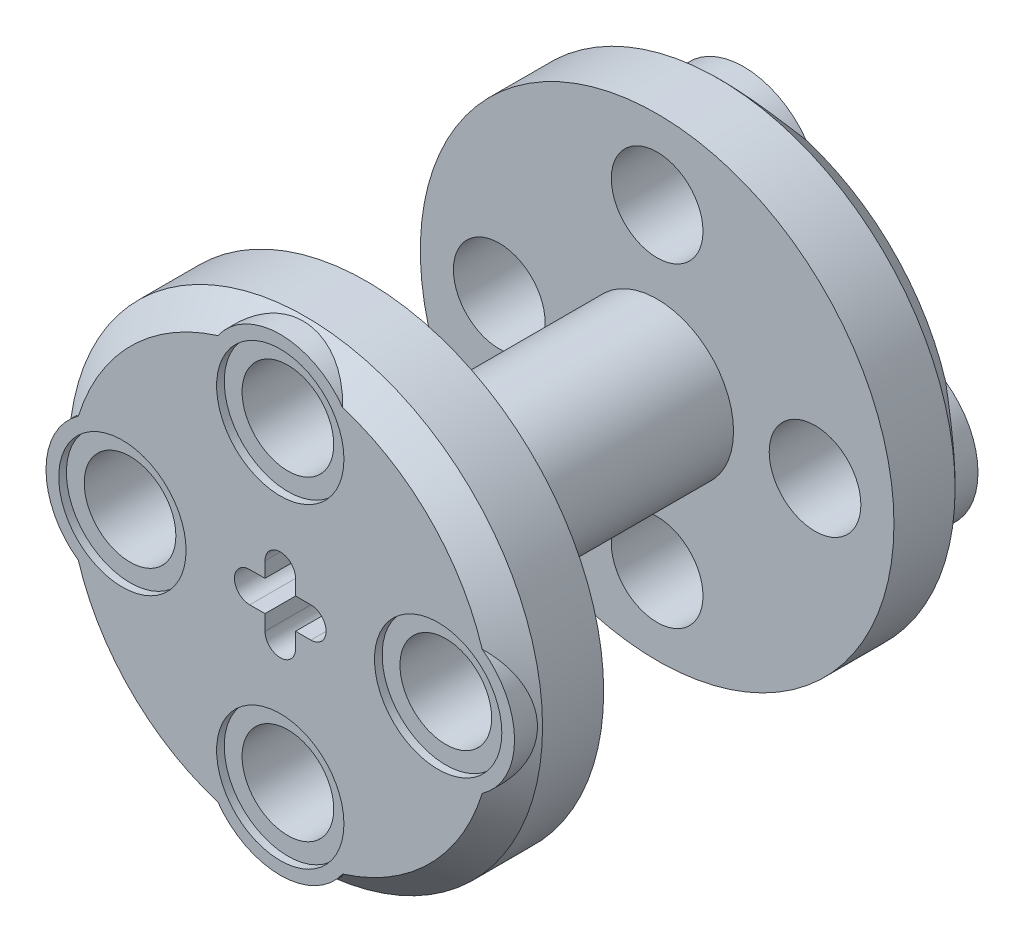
ISO-10303-21;
HEADER;
FILE_DESCRIPTION(('STEP AP214'),'2;1');
FILE_NAME('part.step','',(''),(''),'','','');
FILE_SCHEMA(('AUTOMOTIVE_DESIGN { 1 0 10303 214 1 1 1 1 }'));
ENDSEC;
DATA;
#1=APPLICATION_CONTEXT('core data for automotive mechanical design processes');
#2=APPLICATION_PROTOCOL_DEFINITION('international standard','automotive_design',2000,#1);
#3=PRODUCT_CONTEXT('',#1,'mechanical');
#4=PRODUCT('Part','Part','',(#3));
#5=PRODUCT_RELATED_PRODUCT_CATEGORY('part','',(#4));
#6=PRODUCT_DEFINITION_FORMATION('','',#4);
#7=PRODUCT_DEFINITION_CONTEXT('part definition',#1,'design');
#8=PRODUCT_DEFINITION('design','',#6,#7);
#9=PRODUCT_DEFINITION_SHAPE('','',#8);
#10=(LENGTH_UNIT() NAMED_UNIT(*) SI_UNIT(.MILLI.,.METRE.));
#11=(NAMED_UNIT(*) PLANE_ANGLE_UNIT() SI_UNIT($,.RADIAN.));
#12=(NAMED_UNIT(*) SI_UNIT($,.STERADIAN.) SOLID_ANGLE_UNIT());
#13=UNCERTAINTY_MEASURE_WITH_UNIT(LENGTH_MEASURE(1.E-05),#10,'distance_accuracy_value','');
#14=(GEOMETRIC_REPRESENTATION_CONTEXT(3) GLOBAL_UNCERTAINTY_ASSIGNED_CONTEXT((#13)) GLOBAL_UNIT_ASSIGNED_CONTEXT((#10,
#11,#12)) REPRESENTATION_CONTEXT('',''));
#15=CARTESIAN_POINT('',(0.,0.,0.));
#16=DIRECTION('',(0.,0.,1.));
#17=DIRECTION('',(1.,0.,0.));
#18=AXIS2_PLACEMENT_3D('',#15,#16,#17);
#19=CARTESIAN_POINT('',(-7.874,0.,-18.796));
#20=DIRECTION('',(0.,0.,1.));
#21=DIRECTION('',(-1.,0.,0.));
#22=AXIS2_PLACEMENT_3D('',#19,#20,#21);
#23=CYLINDRICAL_SURFACE('',#22,2.286);
#24=CARTESIAN_POINT('',(-7.874,0.,-14.478));
#25=DIRECTION('',(0.,0.,1.));
#26=DIRECTION('',(1.,0.,0.));
#27=AXIS2_PLACEMENT_3D('',#24,#25,#26);
#28=CIRCLE('',#27,2.286);
#29=CARTESIAN_POINT('',(-5.588,0.,-14.478));
#30=VERTEX_POINT('',#29);
#31=EDGE_CURVE('E348',#30,#30,#28,.T.);
#32=ORIENTED_EDGE('',*,*,#31,.T.);
#33=EDGE_LOOP('',(#32));
#34=FACE_BOUND('',#33,.T.);
#35=CARTESIAN_POINT('',(-7.874,0.,-18.415));
#36=DIRECTION('',(0.,0.,-1.));
#37=DIRECTION('',(-1.,0.,0.));
#38=AXIS2_PLACEMENT_3D('',#35,#36,#37);
#39=CIRCLE('',#38,2.286);
#40=CARTESIAN_POINT('',(-10.16,0.,-18.415));
#41=VERTEX_POINT('',#40);
#42=EDGE_CURVE('E84',#41,#41,#39,.T.);
#43=ORIENTED_EDGE('',*,*,#42,.T.);
#44=EDGE_LOOP('',(#43));
#45=FACE_BOUND('',#44,.T.);
#46=ADVANCED_FACE('F79',(#34,#45),#23,.F.);
#47=CARTESIAN_POINT('',(0.,-7.874,-18.796));
#48=DIRECTION('',(0.,0.,1.));
#49=DIRECTION('',(-1.,0.,0.));
#50=AXIS2_PLACEMENT_3D('',#47,#48,#49);
#51=CYLINDRICAL_SURFACE('',#50,2.286);
#52=CARTESIAN_POINT('',(0.,-7.874,-14.478));
#53=DIRECTION('',(0.,0.,1.));
#54=DIRECTION('',(1.,0.,0.));
#55=AXIS2_PLACEMENT_3D('',#52,#53,#54);
#56=CIRCLE('',#55,2.286);
#57=CARTESIAN_POINT('',(2.286,-7.874,-14.478));
#58=VERTEX_POINT('',#57);
#59=EDGE_CURVE('E345',#58,#58,#56,.T.);
#60=ORIENTED_EDGE('',*,*,#59,.T.);
#61=EDGE_LOOP('',(#60));
#62=FACE_BOUND('',#61,.T.);
#63=CARTESIAN_POINT('',(0.,-7.874,-18.415));
#64=DIRECTION('',(0.,0.,-1.));
#65=DIRECTION('',(-1.,0.,0.));
#66=AXIS2_PLACEMENT_3D('',#63,#64,#65);
#67=CIRCLE('',#66,2.286);
#68=CARTESIAN_POINT('',(-2.286,-7.874,-18.415));
#69=VERTEX_POINT('',#68);
#70=EDGE_CURVE('E443',#69,#69,#67,.T.);
#71=ORIENTED_EDGE('',*,*,#70,.T.);
#72=EDGE_LOOP('',(#71));
#73=FACE_BOUND('',#72,.T.);
#74=ADVANCED_FACE('F474',(#62,#73),#51,.F.);
#75=CARTESIAN_POINT('',(7.874,0.,-18.796));
#76=DIRECTION('',(0.,0.,1.));
#77=DIRECTION('',(-1.,0.,0.));
#78=AXIS2_PLACEMENT_3D('',#75,#76,#77);
#79=CYLINDRICAL_SURFACE('',#78,2.286);
#80=CARTESIAN_POINT('',(7.874,0.,-14.478));
#81=DIRECTION('',(0.,0.,1.));
#82=DIRECTION('',(1.,0.,0.));
#83=AXIS2_PLACEMENT_3D('',#80,#81,#82);
#84=CIRCLE('',#83,2.286);
#85=CARTESIAN_POINT('',(10.16,0.,-14.478));
#86=VERTEX_POINT('',#85);
#87=EDGE_CURVE('E342',#86,#86,#84,.T.);
#88=ORIENTED_EDGE('',*,*,#87,.T.);
#89=EDGE_LOOP('',(#88));
#90=FACE_BOUND('',#89,.T.);
#91=CARTESIAN_POINT('',(7.874,0.,-18.415));
#92=DIRECTION('',(0.,0.,-1.));
#93=DIRECTION('',(-1.,0.,0.));
#94=AXIS2_PLACEMENT_3D('',#91,#92,#93);
#95=CIRCLE('',#94,2.286);
#96=CARTESIAN_POINT('',(5.588,0.,-18.415));
#97=VERTEX_POINT('',#96);
#98=EDGE_CURVE('E436',#97,#97,#95,.T.);
#99=ORIENTED_EDGE('',*,*,#98,.T.);
#100=EDGE_LOOP('',(#99));
#101=FACE_BOUND('',#100,.T.);
#102=ADVANCED_FACE('F480',(#90,#101),#79,.F.);
#103=CARTESIAN_POINT('',(-7.874,0.,4.318));
#104=DIRECTION('',(0.,0.,-1.));
#105=DIRECTION('',(-1.,0.,0.));
#106=AXIS2_PLACEMENT_3D('',#103,#104,#105);
#107=CYLINDRICAL_SURFACE('',#106,2.286);
#108=CARTESIAN_POINT('',(-7.874,0.,0.));
#109=DIRECTION('',(0.,0.,1.));
#110=DIRECTION('',(1.,0.,0.));
#111=AXIS2_PLACEMENT_3D('',#108,#109,#110);
#112=CIRCLE('',#111,2.286);
#113=CARTESIAN_POINT('',(-5.588,0.,0.));
#114=VERTEX_POINT('',#113);
#115=EDGE_CURVE('E263',#114,#114,#112,.T.);
#116=ORIENTED_EDGE('',*,*,#115,.F.);
#117=EDGE_LOOP('',(#116));
#118=FACE_BOUND('',#117,.T.);
#119=CARTESIAN_POINT('',(-7.874,0.,3.937));
#120=DIRECTION('',(0.,0.,1.));
#121=DIRECTION('',(1.,0.,0.));
#122=AXIS2_PLACEMENT_3D('',#119,#120,#121);
#123=CIRCLE('',#122,2.286);
#124=CARTESIAN_POINT('',(-5.588,0.,3.937));
#125=VERTEX_POINT('',#124);
#126=EDGE_CURVE('E429',#125,#125,#123,.T.);
#127=ORIENTED_EDGE('',*,*,#126,.T.);
#128=EDGE_LOOP('',(#127));
#129=FACE_BOUND('',#128,.T.);
#130=ADVANCED_FACE('F490',(#118,#129),#107,.F.);
#131=CARTESIAN_POINT('',(0.,-7.874,4.318));
#132=DIRECTION('',(0.,0.,-1.));
#133=DIRECTION('',(-1.,0.,0.));
#134=AXIS2_PLACEMENT_3D('',#131,#132,#133);
#135=CYLINDRICAL_SURFACE('',#134,2.286);
#136=CARTESIAN_POINT('',(0.,-7.874,0.));
#137=DIRECTION('',(0.,0.,1.));
#138=DIRECTION('',(1.,0.,0.));
#139=AXIS2_PLACEMENT_3D('',#136,#137,#138);
#140=CIRCLE('',#139,2.286);
#141=CARTESIAN_POINT('',(2.286,-7.874,0.));
#142=VERTEX_POINT('',#141);
#143=EDGE_CURVE('E260',#142,#142,#140,.T.);
#144=ORIENTED_EDGE('',*,*,#143,.F.);
#145=EDGE_LOOP('',(#144));
#146=FACE_BOUND('',#145,.T.);
#147=CARTESIAN_POINT('',(0.,-7.874,3.937));
#148=DIRECTION('',(0.,0.,1.));
#149=DIRECTION('',(1.,0.,0.));
#150=AXIS2_PLACEMENT_3D('',#147,#148,#149);
#151=CIRCLE('',#150,2.286);
#152=CARTESIAN_POINT('',(2.286,-7.874,3.937));
#153=VERTEX_POINT('',#152);
#154=EDGE_CURVE('E422',#153,#153,#151,.T.);
#155=ORIENTED_EDGE('',*,*,#154,.T.);
#156=EDGE_LOOP('',(#155));
#157=FACE_BOUND('',#156,.T.);
#158=ADVANCED_FACE('F679',(#146,#157),#135,.F.);
#159=CARTESIAN_POINT('',(7.874,0.,4.318));
#160=DIRECTION('',(0.,0.,-1.));
#161=DIRECTION('',(-1.,0.,0.));
#162=AXIS2_PLACEMENT_3D('',#159,#160,#161);
#163=CYLINDRICAL_SURFACE('',#162,2.286);
#164=CARTESIAN_POINT('',(7.874,0.,0.));
#165=DIRECTION('',(0.,0.,1.));
#166=DIRECTION('',(1.,0.,0.));
#167=AXIS2_PLACEMENT_3D('',#164,#165,#166);
#168=CIRCLE('',#167,2.286);
#169=CARTESIAN_POINT('',(10.16,0.,0.));
#170=VERTEX_POINT('',#169);
#171=EDGE_CURVE('E255',#170,#170,#168,.T.);
#172=ORIENTED_EDGE('',*,*,#171,.F.);
#173=EDGE_LOOP('',(#172));
#174=FACE_BOUND('',#173,.T.);
#175=CARTESIAN_POINT('',(7.874,0.,3.937));
#176=DIRECTION('',(0.,0.,1.));
#177=DIRECTION('',(1.,0.,0.));
#178=AXIS2_PLACEMENT_3D('',#175,#176,#177);
#179=CIRCLE('',#178,2.286);
#180=CARTESIAN_POINT('',(10.16,0.,3.937));
#181=VERTEX_POINT('',#180);
#182=EDGE_CURVE('E417',#181,#181,#179,.T.);
#183=ORIENTED_EDGE('',*,*,#182,.T.);
#184=EDGE_LOOP('',(#183));
#185=FACE_BOUND('',#184,.T.);
#186=ADVANCED_FACE('F496',(#174,#185),#163,.F.);
#187=CARTESIAN_POINT('',(0.,7.874,-18.796));
#188=DIRECTION('',(0.,0.,1.));
#189=DIRECTION('',(-1.,0.,0.));
#190=AXIS2_PLACEMENT_3D('',#187,#188,#189);
#191=CYLINDRICAL_SURFACE('',#190,2.286);
#192=CARTESIAN_POINT('',(0.,7.874,-14.478));
#193=DIRECTION('',(0.,0.,1.));
#194=DIRECTION('',(1.,0.,0.));
#195=AXIS2_PLACEMENT_3D('',#192,#193,#194);
#196=CIRCLE('',#195,2.286);
#197=CARTESIAN_POINT('',(2.286,7.874,-14.478));
#198=VERTEX_POINT('',#197);
#199=EDGE_CURVE('E339',#198,#198,#196,.T.);
#200=ORIENTED_EDGE('',*,*,#199,.T.);
#201=EDGE_LOOP('',(#200));
#202=FACE_BOUND('',#201,.T.);
#203=CARTESIAN_POINT('',(0.,7.874,-18.415));
#204=DIRECTION('',(0.,0.,-1.));
#205=DIRECTION('',(-1.,0.,0.));
#206=AXIS2_PLACEMENT_3D('',#203,#204,#205);
#207=CIRCLE('',#206,2.286);
#208=CARTESIAN_POINT('',(-2.286,7.874,-18.415));
#209=VERTEX_POINT('',#208);
#210=EDGE_CURVE('E396',#209,#209,#207,.T.);
#211=ORIENTED_EDGE('',*,*,#210,.T.);
#212=EDGE_LOOP('',(#211));
#213=FACE_BOUND('',#212,.T.);
#214=ADVANCED_FACE('F492',(#202,#213),#191,.F.);
#215=CARTESIAN_POINT('',(0.,7.874,4.318));
#216=DIRECTION('',(0.,0.,-1.));
#217=DIRECTION('',(-1.,0.,0.));
#218=AXIS2_PLACEMENT_3D('',#215,#216,#217);
#219=CYLINDRICAL_SURFACE('',#218,2.286);
#220=CARTESIAN_POINT('',(0.,7.874,0.));
#221=DIRECTION('',(0.,0.,1.));
#222=DIRECTION('',(1.,0.,0.));
#223=AXIS2_PLACEMENT_3D('',#220,#221,#222);
#224=CIRCLE('',#223,2.286);
#225=CARTESIAN_POINT('',(2.286,7.874,0.));
#226=VERTEX_POINT('',#225);
#227=EDGE_CURVE('E251',#226,#226,#224,.T.);
#228=ORIENTED_EDGE('',*,*,#227,.F.);
#229=EDGE_LOOP('',(#228));
#230=FACE_BOUND('',#229,.T.);
#231=CARTESIAN_POINT('',(0.,7.874,3.937));
#232=DIRECTION('',(0.,0.,1.));
#233=DIRECTION('',(1.,0.,0.));
#234=AXIS2_PLACEMENT_3D('',#231,#232,#233);
#235=CIRCLE('',#234,2.286);
#236=CARTESIAN_POINT('',(2.286,7.874,3.937));
#237=VERTEX_POINT('',#236);
#238=EDGE_CURVE('E391',#237,#237,#235,.T.);
#239=ORIENTED_EDGE('',*,*,#238,.T.);
#240=EDGE_LOOP('',(#239));
#241=FACE_BOUND('',#240,.T.);
#242=ADVANCED_FACE('F495',(#230,#241),#219,.F.);
#243=CARTESIAN_POINT('',(0.,0.,4.318));
#244=DIRECTION('',(0.,0.,1.));
#245=DIRECTION('',(1.,0.,0.));
#246=AXIS2_PLACEMENT_3D('',#243,#244,#245);
#247=PLANE('',#246);
#248=CARTESIAN_POINT('',(-7.874,0.,4.318));
#249=DIRECTION('',(0.,0.,1.));
#250=DIRECTION('',(0.,1.,0.));
#251=AXIS2_PLACEMENT_3D('',#248,#249,#250);
#252=CIRCLE('',#251,3.175);
#253=CARTESIAN_POINT('',(-4.699,0.,4.318));
#254=VERTEX_POINT('',#253);
#255=EDGE_CURVE('E432',#254,#254,#252,.T.);
#256=ORIENTED_EDGE('',*,*,#255,.F.);
#257=EDGE_LOOP('',(#256));
#258=FACE_BOUND('',#257,.T.);
#259=CARTESIAN_POINT('',(0.,-7.874,4.318));
#260=DIRECTION('',(0.,0.,1.));
#261=DIRECTION('',(-1.,0.,0.));
#262=AXIS2_PLACEMENT_3D('',#259,#260,#261);
#263=CIRCLE('',#262,3.175);
#264=CARTESIAN_POINT('',(3.175,-7.874,4.318));
#265=VERTEX_POINT('',#264);
#266=EDGE_CURVE('E425',#265,#265,#263,.T.);
#267=ORIENTED_EDGE('',*,*,#266,.F.);
#268=EDGE_LOOP('',(#267));
#269=FACE_BOUND('',#268,.T.);
#270=CARTESIAN_POINT('',(7.874,0.,4.318));
#271=DIRECTION('',(0.,0.,1.));
#272=DIRECTION('',(0.,-1.,0.));
#273=AXIS2_PLACEMENT_3D('',#270,#271,#272);
#274=CIRCLE('',#273,3.175);
#275=CARTESIAN_POINT('',(11.049,0.,4.318));
#276=VERTEX_POINT('',#275);
#277=EDGE_CURVE('E418',#276,#276,#274,.T.);
#278=ORIENTED_EDGE('',*,*,#277,.F.);
#279=EDGE_LOOP('',(#278));
#280=FACE_BOUND('',#279,.T.);
#281=CARTESIAN_POINT('',(0.,0.,4.318));
#282=DIRECTION('',(0.,0.,1.));
#283=DIRECTION('',(1.,0.,0.));
#284=AXIS2_PLACEMENT_3D('',#281,#282,#283);
#285=CIRCLE('',#284,10.541);
#286=CARTESIAN_POINT('',(-3.11283659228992,10.0708951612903,4.318));
#287=VERTEX_POINT('',#286);
#288=CARTESIAN_POINT('',(-10.0708951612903,3.11283659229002,4.318));
#289=VERTEX_POINT('',#288);
#290=EDGE_CURVE('E228',#287,#289,#285,.T.);
#291=ORIENTED_EDGE('',*,*,#290,.T.);
#292=CARTESIAN_POINT('',(-7.874,0.,4.318));
#293=DIRECTION('',(0.,0.,1.));
#294=DIRECTION('',(0.,1.,0.));
#295=AXIS2_PLACEMENT_3D('',#292,#293,#294);
#296=CIRCLE('',#295,3.81);
#297=CARTESIAN_POINT('',(-10.0708951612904,-3.11283659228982,4.318));
#298=VERTEX_POINT('',#297);
#299=EDGE_CURVE('E214',#289,#298,#296,.T.);
#300=ORIENTED_EDGE('',*,*,#299,.T.);
#301=CARTESIAN_POINT('',(-3.11283659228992,-10.0708951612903,4.318));
#302=VERTEX_POINT('',#301);
#303=EDGE_CURVE('E230',#298,#302,#285,.T.);
#304=ORIENTED_EDGE('',*,*,#303,.T.);
#305=CARTESIAN_POINT('',(0.,-7.874,4.318));
#306=DIRECTION('',(0.,0.,1.));
#307=DIRECTION('',(-1.,0.,0.));
#308=AXIS2_PLACEMENT_3D('',#305,#306,#307);
#309=CIRCLE('',#308,3.81);
#310=CARTESIAN_POINT('',(3.11283659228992,-10.0708951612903,4.318));
#311=VERTEX_POINT('',#310);
#312=EDGE_CURVE('E221',#302,#311,#309,.T.);
#313=ORIENTED_EDGE('',*,*,#312,.T.);
#314=CARTESIAN_POINT('',(10.0708951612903,-3.11283659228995,4.318));
#315=VERTEX_POINT('',#314);
#316=EDGE_CURVE('E245',#311,#315,#285,.T.);
#317=ORIENTED_EDGE('',*,*,#316,.T.);
#318=CARTESIAN_POINT('',(7.874,0.,4.318));
#319=DIRECTION('',(0.,0.,1.));
#320=DIRECTION('',(0.,-1.,0.));
#321=AXIS2_PLACEMENT_3D('',#318,#319,#320);
#322=CIRCLE('',#321,3.81);
#323=CARTESIAN_POINT('',(10.0708951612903,3.11283659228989,4.318));
#324=VERTEX_POINT('',#323);
#325=EDGE_CURVE('E403',#315,#324,#322,.T.);
#326=ORIENTED_EDGE('',*,*,#325,.T.);
#327=CARTESIAN_POINT('',(3.11283659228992,10.0708951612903,4.318));
#328=VERTEX_POINT('',#327);
#329=EDGE_CURVE('E241',#324,#328,#285,.T.);
#330=ORIENTED_EDGE('',*,*,#329,.T.);
#331=CARTESIAN_POINT('',(0.,7.874,4.318));
#332=DIRECTION('',(0.,0.,1.));
#333=DIRECTION('',(1.,0.,0.));
#334=AXIS2_PLACEMENT_3D('',#331,#332,#333);
#335=CIRCLE('',#334,3.81);
#336=EDGE_CURVE('E238',#328,#287,#335,.T.);
#337=ORIENTED_EDGE('',*,*,#336,.T.);
#338=EDGE_LOOP('',(#291,#300,#304,#313,#317,#326,#330,#337));
#339=FACE_BOUND('',#338,.T.);
#340=CARTESIAN_POINT('',(0.,7.874,4.318));
#341=DIRECTION('',(0.,0.,1.));
#342=DIRECTION('',(1.,0.,0.));
#343=AXIS2_PLACEMENT_3D('',#340,#341,#342);
#344=CIRCLE('',#343,3.175);
#345=CARTESIAN_POINT('',(3.175,7.874,4.318));
#346=VERTEX_POINT('',#345);
#347=EDGE_CURVE('E392',#346,#346,#344,.T.);
#348=ORIENTED_EDGE('',*,*,#347,.F.);
#349=EDGE_LOOP('',(#348));
#350=FACE_BOUND('',#349,.T.);
#351=CARTESIAN_POINT('',(-1.524,0.,4.318));
#352=DIRECTION('',(0.,0.,1.));
#353=DIRECTION('',(1.,0.,0.));
#354=AXIS2_PLACEMENT_3D('',#351,#352,#353);
#355=CIRCLE('',#354,0.762);
#356=CARTESIAN_POINT('',(-1.524,0.761999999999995,4.318));
#357=VERTEX_POINT('',#356);
#358=CARTESIAN_POINT('',(-1.524,-0.762000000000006,4.318));
#359=VERTEX_POINT('',#358);
#360=EDGE_CURVE('E321',#357,#359,#355,.T.);
#361=ORIENTED_EDGE('',*,*,#360,.F.);
#362=DIRECTION('',(1.,0.,0.));
#363=VECTOR('',#362,1.);
#364=CARTESIAN_POINT('',(-0.400633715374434,0.761999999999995,4.318));
#365=LINE('',#364,#363);
#366=CARTESIAN_POINT('',(-0.762,0.761999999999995,4.318));
#367=VERTEX_POINT('',#366);
#368=EDGE_CURVE('E324',#357,#367,#365,.T.);
#369=ORIENTED_EDGE('',*,*,#368,.T.);
#370=DIRECTION('',(0.,-1.,0.));
#371=VECTOR('',#370,1.);
#372=CARTESIAN_POINT('',(-0.761999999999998,-25.0933470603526,4.318));
#373=LINE('',#372,#371);
#374=CARTESIAN_POINT('',(-0.762,1.52399999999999,4.318));
#375=VERTEX_POINT('',#374);
#376=EDGE_CURVE('E271',#375,#367,#373,.T.);
#377=ORIENTED_EDGE('',*,*,#376,.F.);
#378=CARTESIAN_POINT('',(0.,1.524,4.318));
#379=DIRECTION('',(0.,0.,1.));
#380=DIRECTION('',(1.,0.,0.));
#381=AXIS2_PLACEMENT_3D('',#378,#379,#380);
#382=CIRCLE('',#381,0.762);
#383=CARTESIAN_POINT('',(0.762,1.52399999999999,4.318));
#384=VERTEX_POINT('',#383);
#385=EDGE_CURVE('E294',#384,#375,#382,.T.);
#386=ORIENTED_EDGE('',*,*,#385,.F.);
#387=DIRECTION('',(0.,-1.,0.));
#388=VECTOR('',#387,1.);
#389=CARTESIAN_POINT('',(0.762000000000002,-25.0933470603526,4.318));
#390=LINE('',#389,#388);
#391=CARTESIAN_POINT('',(0.762,0.761999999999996,4.318));
#392=VERTEX_POINT('',#391);
#393=EDGE_CURVE('E297',#384,#392,#390,.T.);
#394=ORIENTED_EDGE('',*,*,#393,.T.);
#395=DIRECTION('',(1.,0.,0.));
#396=VECTOR('',#395,1.);
#397=CARTESIAN_POINT('',(-0.400633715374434,0.761999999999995,4.318));
#398=LINE('',#397,#396);
#399=CARTESIAN_POINT('',(1.524,0.761999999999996,4.318));
#400=VERTEX_POINT('',#399);
#401=EDGE_CURVE('E300',#392,#400,#398,.T.);
#402=ORIENTED_EDGE('',*,*,#401,.T.);
#403=CARTESIAN_POINT('',(1.524,0.,4.318));
#404=DIRECTION('',(0.,0.,1.));
#405=DIRECTION('',(1.,0.,0.));
#406=AXIS2_PLACEMENT_3D('',#403,#404,#405);
#407=CIRCLE('',#406,0.762);
#408=CARTESIAN_POINT('',(1.524,-0.762000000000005,4.318));
#409=VERTEX_POINT('',#408);
#410=EDGE_CURVE('E303',#409,#400,#407,.T.);
#411=ORIENTED_EDGE('',*,*,#410,.F.);
#412=DIRECTION('',(1.,0.,0.));
#413=VECTOR('',#412,1.);
#414=CARTESIAN_POINT('',(-0.400633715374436,-0.762000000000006,4.318));
#415=LINE('',#414,#413);
#416=CARTESIAN_POINT('',(0.762,-0.762000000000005,4.318));
#417=VERTEX_POINT('',#416);
#418=EDGE_CURVE('E306',#417,#409,#415,.T.);
#419=ORIENTED_EDGE('',*,*,#418,.F.);
#420=DIRECTION('',(0.,-1.,0.));
#421=VECTOR('',#420,1.);
#422=CARTESIAN_POINT('',(0.762000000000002,-25.0933470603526,4.318));
#423=LINE('',#422,#421);
#424=CARTESIAN_POINT('',(0.762,-1.524,4.318));
#425=VERTEX_POINT('',#424);
#426=EDGE_CURVE('E309',#417,#425,#423,.T.);
#427=ORIENTED_EDGE('',*,*,#426,.T.);
#428=CARTESIAN_POINT('',(0.,-1.524,4.318));
#429=DIRECTION('',(0.,0.,1.));
#430=DIRECTION('',(1.,0.,0.));
#431=AXIS2_PLACEMENT_3D('',#428,#429,#430);
#432=CIRCLE('',#431,0.762);
#433=CARTESIAN_POINT('',(-0.762,-1.524,4.318));
#434=VERTEX_POINT('',#433);
#435=EDGE_CURVE('E312',#434,#425,#432,.T.);
#436=ORIENTED_EDGE('',*,*,#435,.F.);
#437=DIRECTION('',(0.,-1.,0.));
#438=VECTOR('',#437,1.);
#439=CARTESIAN_POINT('',(-0.761999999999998,-25.0933470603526,4.318));
#440=LINE('',#439,#438);
#441=CARTESIAN_POINT('',(-0.762,-0.762000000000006,4.318));
#442=VERTEX_POINT('',#441);
#443=EDGE_CURVE('E315',#442,#434,#440,.T.);
#444=ORIENTED_EDGE('',*,*,#443,.F.);
#445=DIRECTION('',(1.,0.,0.));
#446=VECTOR('',#445,1.);
#447=CARTESIAN_POINT('',(-0.400633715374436,-0.762000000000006,4.318));
#448=LINE('',#447,#446);
#449=EDGE_CURVE('E318',#359,#442,#448,.T.);
#450=ORIENTED_EDGE('',*,*,#449,.F.);
#451=EDGE_LOOP('',(#361,#369,#377,#386,#394,#402,#411,#419,#427,#436,#444,#450));
#452=FACE_BOUND('',#451,.T.);
#453=ADVANCED_FACE('F235',(#258,#269,#280,#339,#350,#452),#247,.T.);
#454=CARTESIAN_POINT('',(0.,0.,0.));
#455=DIRECTION('',(0.,0.,1.));
#456=DIRECTION('',(1.,0.,0.));
#457=AXIS2_PLACEMENT_3D('',#454,#455,#456);
#458=PLANE('',#457);
#459=CARTESIAN_POINT('',(0.,0.,0.));
#460=DIRECTION('',(0.,0.,1.));
#461=DIRECTION('',(1.,0.,0.));
#462=AXIS2_PLACEMENT_3D('',#459,#460,#461);
#463=CIRCLE('',#462,11.811);
#464=CARTESIAN_POINT('',(11.811,0.,0.));
#465=VERTEX_POINT('',#464);
#466=EDGE_CURVE('E247',#465,#465,#463,.T.);
#467=ORIENTED_EDGE('',*,*,#466,.F.);
#468=EDGE_LOOP('',(#467));
#469=FACE_BOUND('',#468,.T.);
#470=CARTESIAN_POINT('',(0.,0.,0.));
#471=DIRECTION('',(0.,0.,1.));
#472=DIRECTION('',(1.,0.,0.));
#473=AXIS2_PLACEMENT_3D('',#470,#471,#472);
#474=CIRCLE('',#473,3.81);
#475=CARTESIAN_POINT('',(3.81,0.,0.));
#476=VERTEX_POINT('',#475);
#477=EDGE_CURVE('E243',#476,#476,#474,.F.);
#478=ORIENTED_EDGE('',*,*,#477,.F.);
#479=EDGE_LOOP('',(#478));
#480=FACE_BOUND('',#479,.T.);
#481=ORIENTED_EDGE('',*,*,#227,.T.);
#482=EDGE_LOOP('',(#481));
#483=FACE_BOUND('',#482,.T.);
#484=ORIENTED_EDGE('',*,*,#171,.T.);
#485=EDGE_LOOP('',(#484));
#486=FACE_BOUND('',#485,.T.);
#487=ORIENTED_EDGE('',*,*,#143,.T.);
#488=EDGE_LOOP('',(#487));
#489=FACE_BOUND('',#488,.T.);
#490=ORIENTED_EDGE('',*,*,#115,.T.);
#491=EDGE_LOOP('',(#490));
#492=FACE_BOUND('',#491,.T.);
#493=ADVANCED_FACE('F695',(#469,#480,#483,#486,#489,#492),#458,.F.);
#494=CARTESIAN_POINT('',(0.,0.,4.318));
#495=DIRECTION('',(0.,0.,-1.));
#496=DIRECTION('',(-1.,0.,0.));
#497=AXIS2_PLACEMENT_3D('',#494,#495,#496);
#498=CYLINDRICAL_SURFACE('',#497,11.811);
#499=CARTESIAN_POINT('',(0.,0.,3.048));
#500=DIRECTION('',(0.,0.,1.));
#501=DIRECTION('',(1.,0.,0.));
#502=AXIS2_PLACEMENT_3D('',#499,#500,#501);
#503=CIRCLE('',#502,11.811);
#504=CARTESIAN_POINT('',(11.811,0.,3.048));
#505=VERTEX_POINT('',#504);
#506=EDGE_CURVE('E239',#505,#505,#503,.F.);
#507=ORIENTED_EDGE('',*,*,#506,.T.);
#508=EDGE_LOOP('',(#507));
#509=FACE_BOUND('',#508,.T.);
#510=ORIENTED_EDGE('',*,*,#466,.T.);
#511=EDGE_LOOP('',(#510));
#512=FACE_BOUND('',#511,.T.);
#513=ADVANCED_FACE('F698',(#509,#512),#498,.T.);
#514=CARTESIAN_POINT('',(0.,0.,4.318));
#515=DIRECTION('',(0.,0.,-1.));
#516=DIRECTION('',(-1.,0.,0.));
#517=AXIS2_PLACEMENT_3D('',#514,#515,#516);
#518=CONICAL_SURFACE('',#517,10.541,0.785398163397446);
#519=CARTESIAN_POINT('',(-10.0706274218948,3.11302553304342,4.31820000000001));
#520=CARTESIAN_POINT('',(-10.1503782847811,3.05675781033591,4.25862341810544));
#521=CARTESIAN_POINT('',(-10.2287584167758,2.9968535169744,4.20058093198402));
#522=CARTESIAN_POINT('',(-10.3821034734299,2.8697446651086,4.08789266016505));
#523=CARTESIAN_POINT('',(-10.4570653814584,2.80253382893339,4.03324985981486));
#524=CARTESIAN_POINT('',(-10.6033221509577,2.66033531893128,3.92738674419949));
#525=CARTESIAN_POINT('',(-10.6745842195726,2.58529159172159,3.87619612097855));
#526=CARTESIAN_POINT('',(-10.8119701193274,2.42803007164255,3.77813665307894));
#527=CARTESIAN_POINT('',(-10.8780947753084,2.3458134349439,3.73126711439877));
#528=CARTESIAN_POINT('',(-11.0047253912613,2.17396331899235,3.64201986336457));
#529=CARTESIAN_POINT('',(-11.0651956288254,2.08428867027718,3.59967049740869));
#530=CARTESIAN_POINT('',(-11.1791291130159,1.89844466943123,3.52027321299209));
#531=CARTESIAN_POINT('',(-11.2325964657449,1.80227917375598,3.48322218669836));
#532=CARTESIAN_POINT('',(-11.3315185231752,1.60432860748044,3.41495612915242));
#533=CARTESIAN_POINT('',(-11.3769970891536,1.5025615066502,3.3837237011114));
#534=CARTESIAN_POINT('',(-11.4592946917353,1.29395769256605,3.32739163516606));
#535=CARTESIAN_POINT('',(-11.4961154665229,1.18712200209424,3.30229076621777));
#536=CARTESIAN_POINT('',(-11.5561615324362,0.983628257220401,3.26145647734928));
#537=CARTESIAN_POINT('',(-11.5805352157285,0.88746703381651,3.2449271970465));
#538=CARTESIAN_POINT('',(-11.6217972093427,0.692826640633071,3.21698632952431));
#539=CARTESIAN_POINT('',(-11.6386865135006,0.594347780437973,3.2055740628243));
#540=CARTESIAN_POINT('',(-11.6646979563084,0.395887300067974,3.18801183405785));
#541=CARTESIAN_POINT('',(-11.6738187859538,0.295905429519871,3.18186275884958));
#542=CARTESIAN_POINT('',(-11.6841298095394,0.0953519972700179,3.174911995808));
#543=CARTESIAN_POINT('',(-11.6853205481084,-0.00521952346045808,3.17410994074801));
#544=CARTESIAN_POINT('',(-11.6800368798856,-0.195710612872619,3.17767098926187));
#545=CARTESIAN_POINT('',(-11.6743380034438,-0.285662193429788,3.18151149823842));
#546=CARTESIAN_POINT('',(-11.6566303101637,-0.464665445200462,3.19345797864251));
#547=CARTESIAN_POINT('',(-11.6446193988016,-0.553716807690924,3.20156536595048));
#548=CARTESIAN_POINT('',(-11.5993456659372,-0.818436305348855,3.23217067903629));
#549=CARTESIAN_POINT('',(-11.556834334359,-0.991920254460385,3.26095670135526));
#550=CARTESIAN_POINT('',(-11.449253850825,-1.32854444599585,3.33422665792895));
#551=CARTESIAN_POINT('',(-11.3841308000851,-1.49165886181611,3.37874810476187));
#552=CARTESIAN_POINT('',(-11.2343766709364,-1.80387252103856,3.48192468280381));
#553=CARTESIAN_POINT('',(-11.1497367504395,-1.9529653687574,3.54058622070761));
#554=CARTESIAN_POINT('',(-10.9558647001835,-2.24769489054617,3.67623706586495));
#555=CARTESIAN_POINT('',(-10.8450891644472,-2.39176083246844,3.75441377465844));
#556=CARTESIAN_POINT('',(-10.6087559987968,-2.6587570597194,3.92327762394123));
#557=CARTESIAN_POINT('',(-10.4832012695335,-2.78169148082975,4.01396231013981));
#558=CARTESIAN_POINT('',(-10.3065760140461,-2.93297147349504,4.14334252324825));
#559=CARTESIAN_POINT('',(-10.2601250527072,-2.97086924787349,4.1775260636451));
#560=CARTESIAN_POINT('',(-10.1661621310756,-3.04394821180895,4.24701867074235));
#561=CARTESIAN_POINT('',(-10.1186527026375,-3.07913513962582,4.28232512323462));
#562=CARTESIAN_POINT('',(-10.0706274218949,-3.11302553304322,4.31820000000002));
#563=B_SPLINE_CURVE_WITH_KNOTS('',3,(#519,#520,#521,#522,#523,#524,#525,#526,#527,#528,#529,
#530,#531,#532,#533,#534,#535,#536,#537,#538,#539,#540,#541,#542,#543,#544,#545,#546,#547,#548,
#549,#550,#551,#552,#553,#554,#555,#556,#557,#558,#559,#560,#561,#562),.UNSPECIFIED.,.F.,.F.,(4,
2,2,2,2,2,2,2,2,2,2,2,2,2,2,2,2,2,2,2,2,4),(0.,0.343021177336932,0.68633943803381,
1.03230922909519,1.37822335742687,1.72619298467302,2.07395765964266,2.42066526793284,
2.76730320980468,3.0685959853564,3.36984874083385,3.67115224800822,3.97243506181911,
4.2427404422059,4.51313557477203,5.05318376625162,5.59452819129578,6.13611835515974,
6.72737401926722,7.31851383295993,7.52549656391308,7.73202837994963),.UNSPECIFIED.);
#564=EDGE_CURVE('E217',#289,#298,#563,.T.);
#565=ORIENTED_EDGE('',*,*,#564,.F.);
#566=ORIENTED_EDGE('',*,*,#290,.F.);
#567=CARTESIAN_POINT('',(3.11302553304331,10.0706274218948,4.31820000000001));
#568=CARTESIAN_POINT('',(3.0567578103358,10.1503782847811,4.25862341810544));
#569=CARTESIAN_POINT('',(2.99685351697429,10.2287584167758,4.20058093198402));
#570=CARTESIAN_POINT('',(2.86974466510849,10.3821034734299,4.08789266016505));
#571=CARTESIAN_POINT('',(2.80253382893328,10.4570653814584,4.03324985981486));
#572=CARTESIAN_POINT('',(2.66033531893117,10.6033221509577,3.92738674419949));
#573=CARTESIAN_POINT('',(2.58529159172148,10.6745842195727,3.87619612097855));
#574=CARTESIAN_POINT('',(2.42803007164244,10.8119701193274,3.77813665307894));
#575=CARTESIAN_POINT('',(2.34581343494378,10.8780947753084,3.73126711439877));
#576=CARTESIAN_POINT('',(2.17396331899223,11.0047253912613,3.64201986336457));
#577=CARTESIAN_POINT('',(2.08428867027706,11.0651956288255,3.59967049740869));
#578=CARTESIAN_POINT('',(1.89844466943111,11.1791291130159,3.52027321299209));
#579=CARTESIAN_POINT('',(1.80227917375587,11.2325964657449,3.48322218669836));
#580=CARTESIAN_POINT('',(1.60432860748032,11.3315185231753,3.41495612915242));
#581=CARTESIAN_POINT('',(1.50256150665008,11.3769970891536,3.3837237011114));
#582=CARTESIAN_POINT('',(1.29395769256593,11.4592946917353,3.32739163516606));
#583=CARTESIAN_POINT('',(1.18712200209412,11.4961154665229,3.30229076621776));
#584=CARTESIAN_POINT('',(0.983628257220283,11.5561615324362,3.26145647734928));
#585=CARTESIAN_POINT('',(0.887467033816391,11.5805352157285,3.2449271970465));
#586=CARTESIAN_POINT('',(0.692826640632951,11.6217972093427,3.21698632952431));
#587=CARTESIAN_POINT('',(0.594347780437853,11.6386865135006,3.2055740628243));
#588=CARTESIAN_POINT('',(0.395887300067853,11.6646979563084,3.18801183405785));
#589=CARTESIAN_POINT('',(0.29590542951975,11.6738187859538,3.18186275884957));
#590=CARTESIAN_POINT('',(0.0953519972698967,11.6841298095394,3.174911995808));
#591=CARTESIAN_POINT('',(-0.00521952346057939,11.6853205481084,3.17410994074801));
#592=CARTESIAN_POINT('',(-0.19571061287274,11.6800368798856,3.17767098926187));
#593=CARTESIAN_POINT('',(-0.28566219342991,11.6743380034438,3.18151149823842));
#594=CARTESIAN_POINT('',(-0.464665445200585,11.6566303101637,3.19345797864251));
#595=CARTESIAN_POINT('',(-0.553716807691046,11.6446193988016,3.20156536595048));
#596=CARTESIAN_POINT('',(-0.818436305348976,11.5993456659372,3.23217067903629));
#597=CARTESIAN_POINT('',(-0.991920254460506,11.556834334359,3.26095670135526));
#598=CARTESIAN_POINT('',(-1.32854444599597,11.449253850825,3.33422665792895));
#599=CARTESIAN_POINT('',(-1.49165886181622,11.3841308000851,3.37874810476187));
#600=CARTESIAN_POINT('',(-1.80387252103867,11.2343766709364,3.48192468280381));
#601=CARTESIAN_POINT('',(-1.95296536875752,11.1497367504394,3.54058622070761));
#602=CARTESIAN_POINT('',(-2.24769489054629,10.9558647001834,3.67623706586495));
#603=CARTESIAN_POINT('',(-2.39176083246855,10.8450891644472,3.75441377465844));
#604=CARTESIAN_POINT('',(-2.65875705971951,10.6087559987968,3.92327762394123));
#605=CARTESIAN_POINT('',(-2.78169148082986,10.4832012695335,4.0139623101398));
#606=CARTESIAN_POINT('',(-2.93297147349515,10.3065760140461,4.14334252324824));
#607=CARTESIAN_POINT('',(-2.97086924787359,10.2601250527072,4.1775260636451));
#608=CARTESIAN_POINT('',(-3.04394821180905,10.1661621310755,4.24701867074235));
#609=CARTESIAN_POINT('',(-3.07913513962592,10.1186527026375,4.28232512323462));
#610=CARTESIAN_POINT('',(-3.11302553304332,10.0706274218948,4.31820000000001));
#611=B_SPLINE_CURVE_WITH_KNOTS('',3,(#567,#568,#569,#570,#571,#572,#573,#574,#575,#576,#577,
#578,#579,#580,#581,#582,#583,#584,#585,#586,#587,#588,#589,#590,#591,#592,#593,#594,#595,#596,
#597,#598,#599,#600,#601,#602,#603,#604,#605,#606,#607,#608,#609,#610),.UNSPECIFIED.,.F.,.F.,(4,
2,2,2,2,2,2,2,2,2,2,2,2,2,2,2,2,2,2,2,2,4),(0.,0.343021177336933,0.68633943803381,
1.03230922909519,1.37822335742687,1.72619298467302,2.07395765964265,2.42066526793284,
2.76730320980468,3.06859598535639,3.36984874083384,3.67115224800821,3.9724350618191,
4.2427404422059,4.51313557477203,5.05318376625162,5.59452819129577,6.13611835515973,
6.72737401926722,7.31851383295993,7.52549656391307,7.73202837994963),.UNSPECIFIED.);
#612=EDGE_CURVE('E1161',#328,#287,#611,.T.);
#613=ORIENTED_EDGE('',*,*,#612,.F.);
#614=ORIENTED_EDGE('',*,*,#329,.F.);
#615=CARTESIAN_POINT('',(10.0706274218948,-3.11302553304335,4.31820000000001));
#616=CARTESIAN_POINT('',(10.1503782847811,-3.05675781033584,4.25862341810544));
#617=CARTESIAN_POINT('',(10.2287584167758,-2.99685351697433,4.20058093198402));
#618=CARTESIAN_POINT('',(10.3821034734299,-2.86974466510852,4.08789266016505));
#619=CARTESIAN_POINT('',(10.4570653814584,-2.80253382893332,4.03324985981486));
#620=CARTESIAN_POINT('',(10.6033221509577,-2.66033531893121,3.92738674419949));
#621=CARTESIAN_POINT('',(10.6745842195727,-2.58529159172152,3.87619612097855));
#622=CARTESIAN_POINT('',(10.8119701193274,-2.42803007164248,3.77813665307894));
#623=CARTESIAN_POINT('',(10.8780947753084,-2.34581343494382,3.73126711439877));
#624=CARTESIAN_POINT('',(11.0047253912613,-2.17396331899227,3.64201986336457));
#625=CARTESIAN_POINT('',(11.0651956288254,-2.0842886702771,3.59967049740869));
#626=CARTESIAN_POINT('',(11.1791291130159,-1.89844466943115,3.52027321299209));
#627=CARTESIAN_POINT('',(11.2325964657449,-1.80227917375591,3.48322218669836));
#628=CARTESIAN_POINT('',(11.3315185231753,-1.60432860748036,3.41495612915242));
#629=CARTESIAN_POINT('',(11.3769970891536,-1.50256150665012,3.3837237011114));
#630=CARTESIAN_POINT('',(11.4592946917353,-1.29395769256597,3.32739163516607));
#631=CARTESIAN_POINT('',(11.4961154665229,-1.18712200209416,3.30229076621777));
#632=CARTESIAN_POINT('',(11.5561615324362,-0.983628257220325,3.26145647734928));
#633=CARTESIAN_POINT('',(11.5805352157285,-0.887467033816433,3.24492719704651));
#634=CARTESIAN_POINT('',(11.6217972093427,-0.692826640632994,3.21698632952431));
#635=CARTESIAN_POINT('',(11.6386865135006,-0.594347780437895,3.2055740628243));
#636=CARTESIAN_POINT('',(11.6646979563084,-0.395887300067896,3.18801183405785));
#637=CARTESIAN_POINT('',(11.6738187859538,-0.295905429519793,3.18186275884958));
#638=CARTESIAN_POINT('',(11.6841298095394,-0.0953519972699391,3.174911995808));
#639=CARTESIAN_POINT('',(11.6853205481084,0.00521952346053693,3.17410994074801));
#640=CARTESIAN_POINT('',(11.6800368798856,0.195710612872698,3.17767098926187));
#641=CARTESIAN_POINT('',(11.6743380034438,0.285662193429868,3.18151149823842));
#642=CARTESIAN_POINT('',(11.6566303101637,0.464665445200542,3.19345797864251));
#643=CARTESIAN_POINT('',(11.6446193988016,0.553716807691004,3.20156536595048));
#644=CARTESIAN_POINT('',(11.5993456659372,0.818436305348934,3.23217067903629));
#645=CARTESIAN_POINT('',(11.556834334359,0.991920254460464,3.26095670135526));
#646=CARTESIAN_POINT('',(11.449253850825,1.32854444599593,3.33422665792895));
#647=CARTESIAN_POINT('',(11.3841308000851,1.49165886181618,3.37874810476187));
#648=CARTESIAN_POINT('',(11.2343766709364,1.80387252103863,3.48192468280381));
#649=CARTESIAN_POINT('',(11.1497367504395,1.95296536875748,3.54058622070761));
#650=CARTESIAN_POINT('',(10.9558647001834,2.24769489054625,3.67623706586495));
#651=CARTESIAN_POINT('',(10.8450891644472,2.39176083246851,3.75441377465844));
#652=CARTESIAN_POINT('',(10.6087559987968,2.65875705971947,3.92327762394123));
#653=CARTESIAN_POINT('',(10.4832012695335,2.78169148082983,4.0139623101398));
#654=CARTESIAN_POINT('',(10.3065760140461,2.93297147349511,4.14334252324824));
#655=CARTESIAN_POINT('',(10.2601250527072,2.97086924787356,4.1775260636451));
#656=CARTESIAN_POINT('',(10.1661621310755,3.04394821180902,4.24701867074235));
#657=CARTESIAN_POINT('',(10.1186527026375,3.07913513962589,4.28232512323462));
#658=CARTESIAN_POINT('',(10.0706274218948,3.11302553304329,4.31820000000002));
#659=B_SPLINE_CURVE_WITH_KNOTS('',3,(#615,#616,#617,#618,#619,#620,#621,#622,#623,#624,#625,
#626,#627,#628,#629,#630,#631,#632,#633,#634,#635,#636,#637,#638,#639,#640,#641,#642,#643,#644,
#645,#646,#647,#648,#649,#650,#651,#652,#653,#654,#655,#656,#657,#658),.UNSPECIFIED.,.F.,.F.,(4,
2,2,2,2,2,2,2,2,2,2,2,2,2,2,2,2,2,2,2,2,4),(0.,0.343021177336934,0.686339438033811,
1.03230922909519,1.37822335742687,1.72619298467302,2.07395765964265,2.42066526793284,
2.76730320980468,3.06859598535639,3.36984874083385,3.67115224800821,3.9724350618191,
4.2427404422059,4.51313557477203,5.05318376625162,5.59452819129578,6.13611835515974,
6.72737401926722,7.31851383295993,7.52549656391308,7.73202837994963),.UNSPECIFIED.);
#660=EDGE_CURVE('E569',#315,#324,#659,.T.);
#661=ORIENTED_EDGE('',*,*,#660,.F.);
#662=ORIENTED_EDGE('',*,*,#316,.F.);
#663=CARTESIAN_POINT('',(-3.11302553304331,-10.0706274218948,4.31820000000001));
#664=CARTESIAN_POINT('',(-3.0567578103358,-10.1503782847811,4.25862341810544));
#665=CARTESIAN_POINT('',(-2.99685351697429,-10.2287584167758,4.20058093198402));
#666=CARTESIAN_POINT('',(-2.86974466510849,-10.3821034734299,4.08789266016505));
#667=CARTESIAN_POINT('',(-2.80253382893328,-10.4570653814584,4.03324985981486));
#668=CARTESIAN_POINT('',(-2.66033531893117,-10.6033221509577,3.92738674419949));
#669=CARTESIAN_POINT('',(-2.58529159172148,-10.6745842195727,3.87619612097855));
#670=CARTESIAN_POINT('',(-2.42803007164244,-10.8119701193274,3.77813665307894));
#671=CARTESIAN_POINT('',(-2.34581343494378,-10.8780947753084,3.73126711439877));
#672=CARTESIAN_POINT('',(-2.17396331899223,-11.0047253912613,3.64201986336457));
#673=CARTESIAN_POINT('',(-2.08428867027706,-11.0651956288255,3.59967049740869));
#674=CARTESIAN_POINT('',(-1.89844466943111,-11.1791291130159,3.52027321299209));
#675=CARTESIAN_POINT('',(-1.80227917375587,-11.2325964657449,3.48322218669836));
#676=CARTESIAN_POINT('',(-1.60432860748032,-11.3315185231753,3.41495612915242));
#677=CARTESIAN_POINT('',(-1.50256150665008,-11.3769970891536,3.3837237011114));
#678=CARTESIAN_POINT('',(-1.29395769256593,-11.4592946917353,3.32739163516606));
#679=CARTESIAN_POINT('',(-1.18712200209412,-11.4961154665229,3.30229076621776));
#680=CARTESIAN_POINT('',(-0.983628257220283,-11.5561615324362,3.26145647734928));
#681=CARTESIAN_POINT('',(-0.887467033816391,-11.5805352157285,3.2449271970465));
#682=CARTESIAN_POINT('',(-0.692826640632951,-11.6217972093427,3.21698632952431));
#683=CARTESIAN_POINT('',(-0.594347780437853,-11.6386865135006,3.2055740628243));
#684=CARTESIAN_POINT('',(-0.395887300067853,-11.6646979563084,3.18801183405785));
#685=CARTESIAN_POINT('',(-0.29590542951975,-11.6738187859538,3.18186275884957));
#686=CARTESIAN_POINT('',(-0.0953519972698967,-11.6841298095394,3.174911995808));
#687=CARTESIAN_POINT('',(0.00521952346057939,-11.6853205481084,3.17410994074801));
#688=CARTESIAN_POINT('',(0.19571061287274,-11.6800368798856,3.17767098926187));
#689=CARTESIAN_POINT('',(0.28566219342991,-11.6743380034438,3.18151149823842));
#690=CARTESIAN_POINT('',(0.464665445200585,-11.6566303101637,3.19345797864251));
#691=CARTESIAN_POINT('',(0.553716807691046,-11.6446193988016,3.20156536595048));
#692=CARTESIAN_POINT('',(0.818436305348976,-11.5993456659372,3.23217067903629));
#693=CARTESIAN_POINT('',(0.991920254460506,-11.556834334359,3.26095670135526));
#694=CARTESIAN_POINT('',(1.32854444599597,-11.449253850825,3.33422665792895));
#695=CARTESIAN_POINT('',(1.49165886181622,-11.3841308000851,3.37874810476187));
#696=CARTESIAN_POINT('',(1.80387252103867,-11.2343766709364,3.48192468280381));
#697=CARTESIAN_POINT('',(1.95296536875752,-11.1497367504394,3.54058622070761));
#698=CARTESIAN_POINT('',(2.24769489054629,-10.9558647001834,3.67623706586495));
#699=CARTESIAN_POINT('',(2.39176083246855,-10.8450891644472,3.75441377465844));
#700=CARTESIAN_POINT('',(2.65875705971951,-10.6087559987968,3.92327762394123));
#701=CARTESIAN_POINT('',(2.78169148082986,-10.4832012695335,4.0139623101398));
#702=CARTESIAN_POINT('',(2.93297147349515,-10.3065760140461,4.14334252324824));
#703=CARTESIAN_POINT('',(2.97086924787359,-10.2601250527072,4.1775260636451));
#704=CARTESIAN_POINT('',(3.04394821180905,-10.1661621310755,4.24701867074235));
#705=CARTESIAN_POINT('',(3.07913513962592,-10.1186527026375,4.28232512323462));
#706=CARTESIAN_POINT('',(3.11302553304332,-10.0706274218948,4.31820000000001));
#707=B_SPLINE_CURVE_WITH_KNOTS('',3,(#663,#664,#665,#666,#667,#668,#669,#670,#671,#672,#673,
#674,#675,#676,#677,#678,#679,#680,#681,#682,#683,#684,#685,#686,#687,#688,#689,#690,#691,#692,
#693,#694,#695,#696,#697,#698,#699,#700,#701,#702,#703,#704,#705,#706),.UNSPECIFIED.,.F.,.F.,(4,
2,2,2,2,2,2,2,2,2,2,2,2,2,2,2,2,2,2,2,2,4),(0.,0.343021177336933,0.68633943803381,
1.03230922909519,1.37822335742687,1.72619298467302,2.07395765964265,2.42066526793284,
2.76730320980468,3.06859598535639,3.36984874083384,3.67115224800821,3.9724350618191,
4.2427404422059,4.51313557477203,5.05318376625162,5.59452819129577,6.13611835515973,
6.72737401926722,7.31851383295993,7.52549656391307,7.73202837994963),.UNSPECIFIED.);
#708=EDGE_CURVE('E232',#302,#311,#707,.T.);
#709=ORIENTED_EDGE('',*,*,#708,.F.);
#710=ORIENTED_EDGE('',*,*,#303,.F.);
#711=EDGE_LOOP('',(#565,#566,#613,#614,#661,#662,#709,#710));
#712=FACE_BOUND('',#711,.T.);
#713=ORIENTED_EDGE('',*,*,#506,.F.);
#714=EDGE_LOOP('',(#713));
#715=FACE_BOUND('',#714,.T.);
#716=ADVANCED_FACE('F81',(#712,#715),#518,.T.);
#717=CARTESIAN_POINT('',(0.,0.,-18.015307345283));
#718=DIRECTION('',(0.,0.,1.));
#719=DIRECTION('',(1.,0.,0.));
#720=AXIS2_PLACEMENT_3D('',#717,#718,#719);
#721=CYLINDRICAL_SURFACE('',#720,3.81);
#722=ORIENTED_EDGE('',*,*,#477,.T.);
#723=EDGE_LOOP('',(#722));
#724=FACE_BOUND('',#723,.T.);
#725=CARTESIAN_POINT('',(0.,0.,-14.478));
#726=DIRECTION('',(0.,0.,1.));
#727=DIRECTION('',(1.,0.,0.));
#728=AXIS2_PLACEMENT_3D('',#725,#726,#727);
#729=CIRCLE('',#728,3.81);
#730=CARTESIAN_POINT('',(3.81,0.,-14.478));
#731=VERTEX_POINT('',#730);
#732=EDGE_CURVE('E327',#731,#731,#729,.F.);
#733=ORIENTED_EDGE('',*,*,#732,.F.);
#734=EDGE_LOOP('',(#733));
#735=FACE_BOUND('',#734,.T.);
#736=ADVANCED_FACE('F705',(#724,#735),#721,.T.);
#737=CARTESIAN_POINT('',(-0.400633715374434,0.761999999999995,-7.239));
#738=DIRECTION('',(0.,-1.,0.));
#739=DIRECTION('',(1.,0.,0.));
#740=AXIS2_PLACEMENT_3D('',#737,#738,#739);
#741=PLANE('',#740);
#742=ORIENTED_EDGE('',*,*,#368,.F.);
#743=DIRECTION('',(0.,0.,1.));
#744=VECTOR('',#743,1.);
#745=CARTESIAN_POINT('',(-1.524,0.761999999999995,-7.239));
#746=LINE('',#745,#744);
#747=CARTESIAN_POINT('',(-1.524,0.761999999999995,-18.796));
#748=VERTEX_POINT('',#747);
#749=EDGE_CURVE('E267',#748,#357,#746,.T.);
#750=ORIENTED_EDGE('',*,*,#749,.F.);
#751=DIRECTION('',(1.,0.,0.));
#752=VECTOR('',#751,1.);
#753=CARTESIAN_POINT('',(-0.400633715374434,0.761999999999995,-18.796));
#754=LINE('',#753,#752);
#755=CARTESIAN_POINT('',(-0.762,0.761999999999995,-18.796));
#756=VERTEX_POINT('',#755);
#757=EDGE_CURVE('E384',#748,#756,#754,.T.);
#758=ORIENTED_EDGE('',*,*,#757,.T.);
#759=DIRECTION('',(0.,0.,1.));
#760=VECTOR('',#759,1.);
#761=CARTESIAN_POINT('',(-0.762,0.761999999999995,-7.239));
#762=LINE('',#761,#760);
#763=EDGE_CURVE('E266',#756,#367,#762,.T.);
#764=ORIENTED_EDGE('',*,*,#763,.T.);
#765=EDGE_LOOP('',(#742,#750,#758,#764));
#766=FACE_BOUND('',#765,.T.);
#767=ADVANCED_FACE('F710',(#766),#741,.T.);
#768=CARTESIAN_POINT('',(-0.761999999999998,-25.0933470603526,-7.239));
#769=DIRECTION('',(-1.,0.,0.));
#770=DIRECTION('',(0.,-1.,0.));
#771=AXIS2_PLACEMENT_3D('',#768,#769,#770);
#772=PLANE('',#771);
#773=ORIENTED_EDGE('',*,*,#376,.T.);
#774=ORIENTED_EDGE('',*,*,#763,.F.);
#775=DIRECTION('',(0.,-1.,0.));
#776=VECTOR('',#775,1.);
#777=CARTESIAN_POINT('',(-0.761999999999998,-25.0933470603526,-18.796));
#778=LINE('',#777,#776);
#779=CARTESIAN_POINT('',(-0.762,1.52399999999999,-18.796));
#780=VERTEX_POINT('',#779);
#781=EDGE_CURVE('E351',#780,#756,#778,.T.);
#782=ORIENTED_EDGE('',*,*,#781,.F.);
#783=DIRECTION('',(0.,0.,1.));
#784=VECTOR('',#783,1.);
#785=CARTESIAN_POINT('',(-0.762,1.52399999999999,-7.239));
#786=LINE('',#785,#784);
#787=EDGE_CURVE('E289',#780,#375,#786,.T.);
#788=ORIENTED_EDGE('',*,*,#787,.T.);
#789=EDGE_LOOP('',(#773,#774,#782,#788));
#790=FACE_BOUND('',#789,.T.);
#791=ADVANCED_FACE('F515',(#790),#772,.F.);
#792=CARTESIAN_POINT('',(0.,1.524,-7.239));
#793=DIRECTION('',(0.,0.,1.));
#794=DIRECTION('',(1.,0.,0.));
#795=AXIS2_PLACEMENT_3D('',#792,#793,#794);
#796=CYLINDRICAL_SURFACE('',#795,0.762);
#797=ORIENTED_EDGE('',*,*,#385,.T.);
#798=ORIENTED_EDGE('',*,*,#787,.F.);
#799=CARTESIAN_POINT('',(0.,1.524,-18.796));
#800=DIRECTION('',(0.,0.,1.));
#801=DIRECTION('',(1.,0.,0.));
#802=AXIS2_PLACEMENT_3D('',#799,#800,#801);
#803=CIRCLE('',#802,0.762);
#804=CARTESIAN_POINT('',(0.762,1.52399999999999,-18.796));
#805=VERTEX_POINT('',#804);
#806=EDGE_CURVE('E354',#805,#780,#803,.T.);
#807=ORIENTED_EDGE('',*,*,#806,.F.);
#808=DIRECTION('',(0.,0.,1.));
#809=VECTOR('',#808,1.);
#810=CARTESIAN_POINT('',(0.762,1.52399999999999,-7.239));
#811=LINE('',#810,#809);
#812=EDGE_CURVE('E287',#805,#384,#811,.T.);
#813=ORIENTED_EDGE('',*,*,#812,.T.);
#814=EDGE_LOOP('',(#797,#798,#807,#813));
#815=FACE_BOUND('',#814,.T.);
#816=ADVANCED_FACE('F1052',(#815),#796,.F.);
#817=CARTESIAN_POINT('',(0.762000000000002,-25.0933470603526,-7.239));
#818=DIRECTION('',(-1.,0.,0.));
#819=DIRECTION('',(0.,-1.,0.));
#820=AXIS2_PLACEMENT_3D('',#817,#818,#819);
#821=PLANE('',#820);
#822=ORIENTED_EDGE('',*,*,#393,.F.);
#823=ORIENTED_EDGE('',*,*,#812,.F.);
#824=DIRECTION('',(0.,-1.,0.));
#825=VECTOR('',#824,1.);
#826=CARTESIAN_POINT('',(0.762000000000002,-25.0933470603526,-18.796));
#827=LINE('',#826,#825);
#828=CARTESIAN_POINT('',(0.762,0.761999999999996,-18.796));
#829=VERTEX_POINT('',#828);
#830=EDGE_CURVE('E357',#805,#829,#827,.T.);
#831=ORIENTED_EDGE('',*,*,#830,.T.);
#832=DIRECTION('',(0.,0.,1.));
#833=VECTOR('',#832,1.);
#834=CARTESIAN_POINT('',(0.762,0.761999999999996,-7.239));
#835=LINE('',#834,#833);
#836=EDGE_CURVE('E285',#829,#392,#835,.T.);
#837=ORIENTED_EDGE('',*,*,#836,.T.);
#838=EDGE_LOOP('',(#822,#823,#831,#837));
#839=FACE_BOUND('',#838,.T.);
#840=ADVANCED_FACE('F1041',(#839),#821,.T.);
#841=CARTESIAN_POINT('',(-0.400633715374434,0.761999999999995,-7.239));
#842=DIRECTION('',(0.,-1.,0.));
#843=DIRECTION('',(1.,0.,0.));
#844=AXIS2_PLACEMENT_3D('',#841,#842,#843);
#845=PLANE('',#844);
#846=ORIENTED_EDGE('',*,*,#401,.F.);
#847=ORIENTED_EDGE('',*,*,#836,.F.);
#848=DIRECTION('',(1.,0.,0.));
#849=VECTOR('',#848,1.);
#850=CARTESIAN_POINT('',(-0.400633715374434,0.761999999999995,-18.796));
#851=LINE('',#850,#849);
#852=CARTESIAN_POINT('',(1.524,0.761999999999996,-18.796));
#853=VERTEX_POINT('',#852);
#854=EDGE_CURVE('E360',#829,#853,#851,.T.);
#855=ORIENTED_EDGE('',*,*,#854,.T.);
#856=DIRECTION('',(0.,0.,1.));
#857=VECTOR('',#856,1.);
#858=CARTESIAN_POINT('',(1.524,0.761999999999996,-7.239));
#859=LINE('',#858,#857);
#860=EDGE_CURVE('E283',#853,#400,#859,.T.);
#861=ORIENTED_EDGE('',*,*,#860,.T.);
#862=EDGE_LOOP('',(#846,#847,#855,#861));
#863=FACE_BOUND('',#862,.T.);
#864=ADVANCED_FACE('F1030',(#863),#845,.T.);
#865=CARTESIAN_POINT('',(1.524,0.,-7.239));
#866=DIRECTION('',(0.,0.,1.));
#867=DIRECTION('',(1.,0.,0.));
#868=AXIS2_PLACEMENT_3D('',#865,#866,#867);
#869=CYLINDRICAL_SURFACE('',#868,0.762);
#870=ORIENTED_EDGE('',*,*,#410,.T.);
#871=ORIENTED_EDGE('',*,*,#860,.F.);
#872=CARTESIAN_POINT('',(1.524,0.,-18.796));
#873=DIRECTION('',(0.,0.,1.));
#874=DIRECTION('',(1.,0.,0.));
#875=AXIS2_PLACEMENT_3D('',#872,#873,#874);
#876=CIRCLE('',#875,0.762);
#877=CARTESIAN_POINT('',(1.524,-0.762000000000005,-18.796));
#878=VERTEX_POINT('',#877);
#879=EDGE_CURVE('E363',#878,#853,#876,.T.);
#880=ORIENTED_EDGE('',*,*,#879,.F.);
#881=DIRECTION('',(0.,0.,1.));
#882=VECTOR('',#881,1.);
#883=CARTESIAN_POINT('',(1.524,-0.762000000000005,-7.239));
#884=LINE('',#883,#882);
#885=EDGE_CURVE('E281',#878,#409,#884,.T.);
#886=ORIENTED_EDGE('',*,*,#885,.T.);
#887=EDGE_LOOP('',(#870,#871,#880,#886));
#888=FACE_BOUND('',#887,.T.);
#889=ADVANCED_FACE('F1019',(#888),#869,.F.);
#890=CARTESIAN_POINT('',(-0.400633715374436,-0.762000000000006,-7.239));
#891=DIRECTION('',(0.,-1.,0.));
#892=DIRECTION('',(1.,0.,0.));
#893=AXIS2_PLACEMENT_3D('',#890,#891,#892);
#894=PLANE('',#893);
#895=ORIENTED_EDGE('',*,*,#418,.T.);
#896=ORIENTED_EDGE('',*,*,#885,.F.);
#897=DIRECTION('',(1.,0.,0.));
#898=VECTOR('',#897,1.);
#899=CARTESIAN_POINT('',(-0.400633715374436,-0.762000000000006,-18.796));
#900=LINE('',#899,#898);
#901=CARTESIAN_POINT('',(0.762,-0.762000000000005,-18.796));
#902=VERTEX_POINT('',#901);
#903=EDGE_CURVE('E366',#902,#878,#900,.T.);
#904=ORIENTED_EDGE('',*,*,#903,.F.);
#905=DIRECTION('',(0.,0.,1.));
#906=VECTOR('',#905,1.);
#907=CARTESIAN_POINT('',(0.762,-0.762000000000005,-7.239));
#908=LINE('',#907,#906);
#909=EDGE_CURVE('E279',#902,#417,#908,.T.);
#910=ORIENTED_EDGE('',*,*,#909,.T.);
#911=EDGE_LOOP('',(#895,#896,#904,#910));
#912=FACE_BOUND('',#911,.T.);
#913=ADVANCED_FACE('F1008',(#912),#894,.F.);
#914=CARTESIAN_POINT('',(0.762000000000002,-25.0933470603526,-7.239));
#915=DIRECTION('',(-1.,0.,0.));
#916=DIRECTION('',(0.,-1.,0.));
#917=AXIS2_PLACEMENT_3D('',#914,#915,#916);
#918=PLANE('',#917);
#919=ORIENTED_EDGE('',*,*,#426,.F.);
#920=ORIENTED_EDGE('',*,*,#909,.F.);
#921=DIRECTION('',(0.,-1.,0.));
#922=VECTOR('',#921,1.);
#923=CARTESIAN_POINT('',(0.762000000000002,-25.0933470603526,-18.796));
#924=LINE('',#923,#922);
#925=CARTESIAN_POINT('',(0.762,-1.524,-18.796));
#926=VERTEX_POINT('',#925);
#927=EDGE_CURVE('E369',#902,#926,#924,.T.);
#928=ORIENTED_EDGE('',*,*,#927,.T.);
#929=DIRECTION('',(0.,0.,1.));
#930=VECTOR('',#929,1.);
#931=CARTESIAN_POINT('',(0.762,-1.524,-7.239));
#932=LINE('',#931,#930);
#933=EDGE_CURVE('E277',#926,#425,#932,.T.);
#934=ORIENTED_EDGE('',*,*,#933,.T.);
#935=EDGE_LOOP('',(#919,#920,#928,#934));
#936=FACE_BOUND('',#935,.T.);
#937=ADVANCED_FACE('F997',(#936),#918,.T.);
#938=CARTESIAN_POINT('',(0.,-1.524,-7.239));
#939=DIRECTION('',(0.,0.,1.));
#940=DIRECTION('',(1.,0.,0.));
#941=AXIS2_PLACEMENT_3D('',#938,#939,#940);
#942=CYLINDRICAL_SURFACE('',#941,0.762);
#943=ORIENTED_EDGE('',*,*,#435,.T.);
#944=ORIENTED_EDGE('',*,*,#933,.F.);
#945=CARTESIAN_POINT('',(0.,-1.524,-18.796));
#946=DIRECTION('',(0.,0.,1.));
#947=DIRECTION('',(1.,0.,0.));
#948=AXIS2_PLACEMENT_3D('',#945,#946,#947);
#949=CIRCLE('',#948,0.762);
#950=CARTESIAN_POINT('',(-0.762,-1.524,-18.796));
#951=VERTEX_POINT('',#950);
#952=EDGE_CURVE('E372',#951,#926,#949,.T.);
#953=ORIENTED_EDGE('',*,*,#952,.F.);
#954=DIRECTION('',(0.,0.,1.));
#955=VECTOR('',#954,1.);
#956=CARTESIAN_POINT('',(-0.762,-1.524,-7.239));
#957=LINE('',#956,#955);
#958=EDGE_CURVE('E275',#951,#434,#957,.T.);
#959=ORIENTED_EDGE('',*,*,#958,.T.);
#960=EDGE_LOOP('',(#943,#944,#953,#959));
#961=FACE_BOUND('',#960,.T.);
#962=ADVANCED_FACE('F986',(#961),#942,.F.);
#963=CARTESIAN_POINT('',(-0.761999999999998,-25.0933470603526,-7.239));
#964=DIRECTION('',(-1.,0.,0.));
#965=DIRECTION('',(0.,-1.,0.));
#966=AXIS2_PLACEMENT_3D('',#963,#964,#965);
#967=PLANE('',#966);
#968=ORIENTED_EDGE('',*,*,#443,.T.);
#969=ORIENTED_EDGE('',*,*,#958,.F.);
#970=DIRECTION('',(0.,-1.,0.));
#971=VECTOR('',#970,1.);
#972=CARTESIAN_POINT('',(-0.761999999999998,-25.0933470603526,-18.796));
#973=LINE('',#972,#971);
#974=CARTESIAN_POINT('',(-0.762,-0.762000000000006,-18.796));
#975=VERTEX_POINT('',#974);
#976=EDGE_CURVE('E375',#975,#951,#973,.T.);
#977=ORIENTED_EDGE('',*,*,#976,.F.);
#978=DIRECTION('',(0.,0.,1.));
#979=VECTOR('',#978,1.);
#980=CARTESIAN_POINT('',(-0.762,-0.762000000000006,-7.239));
#981=LINE('',#980,#979);
#982=EDGE_CURVE('E273',#975,#442,#981,.T.);
#983=ORIENTED_EDGE('',*,*,#982,.T.);
#984=EDGE_LOOP('',(#968,#969,#977,#983));
#985=FACE_BOUND('',#984,.T.);
#986=ADVANCED_FACE('F975',(#985),#967,.F.);
#987=CARTESIAN_POINT('',(-0.400633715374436,-0.762000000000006,-7.239));
#988=DIRECTION('',(0.,-1.,0.));
#989=DIRECTION('',(1.,0.,0.));
#990=AXIS2_PLACEMENT_3D('',#987,#988,#989);
#991=PLANE('',#990);
#992=ORIENTED_EDGE('',*,*,#449,.T.);
#993=ORIENTED_EDGE('',*,*,#982,.F.);
#994=DIRECTION('',(1.,0.,0.));
#995=VECTOR('',#994,1.);
#996=CARTESIAN_POINT('',(-0.400633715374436,-0.762000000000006,-18.796));
#997=LINE('',#996,#995);
#998=CARTESIAN_POINT('',(-1.524,-0.762000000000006,-18.796));
#999=VERTEX_POINT('',#998);
#1000=EDGE_CURVE('E378',#999,#975,#997,.T.);
#1001=ORIENTED_EDGE('',*,*,#1000,.F.);
#1002=DIRECTION('',(0.,0.,1.));
#1003=VECTOR('',#1002,1.);
#1004=CARTESIAN_POINT('',(-1.524,-0.762000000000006,-7.239));
#1005=LINE('',#1004,#1003);
#1006=EDGE_CURVE('E270',#999,#359,#1005,.T.);
#1007=ORIENTED_EDGE('',*,*,#1006,.T.);
#1008=EDGE_LOOP('',(#992,#993,#1001,#1007));
#1009=FACE_BOUND('',#1008,.T.);
#1010=ADVANCED_FACE('F965',(#1009),#991,.F.);
#1011=CARTESIAN_POINT('',(-1.524,0.,-7.239));
#1012=DIRECTION('',(0.,0.,1.));
#1013=DIRECTION('',(1.,0.,0.));
#1014=AXIS2_PLACEMENT_3D('',#1011,#1012,#1013);
#1015=CYLINDRICAL_SURFACE('',#1014,0.762);
#1016=ORIENTED_EDGE('',*,*,#360,.T.);
#1017=ORIENTED_EDGE('',*,*,#1006,.F.);
#1018=CARTESIAN_POINT('',(-1.524,0.,-18.796));
#1019=DIRECTION('',(0.,0.,1.));
#1020=DIRECTION('',(1.,0.,0.));
#1021=AXIS2_PLACEMENT_3D('',#1018,#1019,#1020);
#1022=CIRCLE('',#1021,0.762);
#1023=EDGE_CURVE('E381',#748,#999,#1022,.T.);
#1024=ORIENTED_EDGE('',*,*,#1023,.F.);
#1025=ORIENTED_EDGE('',*,*,#749,.T.);
#1026=EDGE_LOOP('',(#1016,#1017,#1024,#1025));
#1027=FACE_BOUND('',#1026,.T.);
#1028=ADVANCED_FACE('F502',(#1027),#1015,.F.);
#1029=CARTESIAN_POINT('',(0.,0.,-18.796));
#1030=DIRECTION('',(0.,0.,-1.));
#1031=DIRECTION('',(1.,0.,0.));
#1032=AXIS2_PLACEMENT_3D('',#1029,#1030,#1031);
#1033=PLANE('',#1032);
#1034=CARTESIAN_POINT('',(-7.874,0.,-18.796));
#1035=DIRECTION('',(0.,0.,-1.));
#1036=DIRECTION('',(0.,-1.,0.));
#1037=AXIS2_PLACEMENT_3D('',#1034,#1035,#1036);
#1038=CIRCLE('',#1037,3.175);
#1039=CARTESIAN_POINT('',(-11.049,0.,-18.796));
#1040=VERTEX_POINT('',#1039);
#1041=EDGE_CURVE('E452',#1040,#1040,#1038,.T.);
#1042=ORIENTED_EDGE('',*,*,#1041,.F.);
#1043=EDGE_LOOP('',(#1042));
#1044=FACE_BOUND('',#1043,.T.);
#1045=CARTESIAN_POINT('',(0.,-7.874,-18.796));
#1046=DIRECTION('',(0.,0.,-1.));
#1047=DIRECTION('',(1.,0.,0.));
#1048=AXIS2_PLACEMENT_3D('',#1045,#1046,#1047);
#1049=CIRCLE('',#1048,3.175);
#1050=CARTESIAN_POINT('',(-3.175,-7.874,-18.796));
#1051=VERTEX_POINT('',#1050);
#1052=EDGE_CURVE('E446',#1051,#1051,#1049,.T.);
#1053=ORIENTED_EDGE('',*,*,#1052,.F.);
#1054=EDGE_LOOP('',(#1053));
#1055=FACE_BOUND('',#1054,.T.);
#1056=CARTESIAN_POINT('',(7.874,0.,-18.796));
#1057=DIRECTION('',(0.,0.,-1.));
#1058=DIRECTION('',(0.,1.,0.));
#1059=AXIS2_PLACEMENT_3D('',#1056,#1057,#1058);
#1060=CIRCLE('',#1059,3.175);
#1061=CARTESIAN_POINT('',(4.699,0.,-18.796));
#1062=VERTEX_POINT('',#1061);
#1063=EDGE_CURVE('E439',#1062,#1062,#1060,.T.);
#1064=ORIENTED_EDGE('',*,*,#1063,.F.);
#1065=EDGE_LOOP('',(#1064));
#1066=FACE_BOUND('',#1065,.T.);
#1067=CARTESIAN_POINT('',(0.,0.,-18.796));
#1068=DIRECTION('',(0.,0.,1.));
#1069=DIRECTION('',(1.,0.,0.));
#1070=AXIS2_PLACEMENT_3D('',#1067,#1068,#1069);
#1071=CIRCLE('',#1070,10.541);
#1072=CARTESIAN_POINT('',(-10.0708951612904,-3.11283659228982,-18.796));
#1073=VERTEX_POINT('',#1072);
#1074=CARTESIAN_POINT('',(-3.11283659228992,-10.0708951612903,-18.796));
#1075=VERTEX_POINT('',#1074);
#1076=EDGE_CURVE('E334',#1073,#1075,#1071,.T.);
#1077=ORIENTED_EDGE('',*,*,#1076,.F.);
#1078=CARTESIAN_POINT('',(-7.874,0.,-18.796));
#1079=DIRECTION('',(0.,0.,-1.));
#1080=DIRECTION('',(0.,-1.,0.));
#1081=AXIS2_PLACEMENT_3D('',#1078,#1079,#1080);
#1082=CIRCLE('',#1081,3.81);
#1083=CARTESIAN_POINT('',(-10.0708951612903,3.11283659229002,-18.796));
#1084=VERTEX_POINT('',#1083);
#1085=EDGE_CURVE('E414',#1073,#1084,#1082,.T.);
#1086=ORIENTED_EDGE('',*,*,#1085,.T.);
#1087=CARTESIAN_POINT('',(-3.11283659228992,10.0708951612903,-18.796));
#1088=VERTEX_POINT('',#1087);
#1089=EDGE_CURVE('E100',#1088,#1084,#1071,.T.);
#1090=ORIENTED_EDGE('',*,*,#1089,.F.);
#1091=CARTESIAN_POINT('',(0.,7.874,-18.796));
#1092=DIRECTION('',(0.,0.,-1.));
#1093=DIRECTION('',(-1.,0.,0.));
#1094=AXIS2_PLACEMENT_3D('',#1091,#1092,#1093);
#1095=CIRCLE('',#1094,3.81);
#1096=CARTESIAN_POINT('',(3.11283659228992,10.0708951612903,-18.796));
#1097=VERTEX_POINT('',#1096);
#1098=EDGE_CURVE('E388',#1088,#1097,#1095,.T.);
#1099=ORIENTED_EDGE('',*,*,#1098,.T.);
#1100=CARTESIAN_POINT('',(10.0708951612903,3.11283659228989,-18.796));
#1101=VERTEX_POINT('',#1100);
#1102=EDGE_CURVE('E335',#1101,#1097,#1071,.T.);
#1103=ORIENTED_EDGE('',*,*,#1102,.F.);
#1104=CARTESIAN_POINT('',(7.874,0.,-18.796));
#1105=DIRECTION('',(0.,0.,-1.));
#1106=DIRECTION('',(0.,1.,0.));
#1107=AXIS2_PLACEMENT_3D('',#1104,#1105,#1106);
#1108=CIRCLE('',#1107,3.81);
#1109=CARTESIAN_POINT('',(10.0708951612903,-3.11283659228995,-18.796));
#1110=VERTEX_POINT('',#1109);
#1111=EDGE_CURVE('E222',#1101,#1110,#1108,.T.);
#1112=ORIENTED_EDGE('',*,*,#1111,.T.);
#1113=CARTESIAN_POINT('',(3.11283659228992,-10.0708951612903,-18.796));
#1114=VERTEX_POINT('',#1113);
#1115=EDGE_CURVE('E1207',#1114,#1110,#1071,.T.);
#1116=ORIENTED_EDGE('',*,*,#1115,.F.);
#1117=CARTESIAN_POINT('',(0.,-7.874,-18.796));
#1118=DIRECTION('',(0.,0.,-1.));
#1119=DIRECTION('',(1.,0.,0.));
#1120=AXIS2_PLACEMENT_3D('',#1117,#1118,#1119);
#1121=CIRCLE('',#1120,3.81);
#1122=EDGE_CURVE('E411',#1114,#1075,#1121,.T.);
#1123=ORIENTED_EDGE('',*,*,#1122,.T.);
#1124=EDGE_LOOP('',(#1077,#1086,#1090,#1099,#1103,#1112,#1116,#1123));
#1125=FACE_BOUND('',#1124,.T.);
#1126=CARTESIAN_POINT('',(0.,7.874,-18.796));
#1127=DIRECTION('',(0.,0.,-1.));
#1128=DIRECTION('',(-1.,0.,0.));
#1129=AXIS2_PLACEMENT_3D('',#1126,#1127,#1128);
#1130=CIRCLE('',#1129,3.175);
#1131=CARTESIAN_POINT('',(-3.175,7.874,-18.796));
#1132=VERTEX_POINT('',#1131);
#1133=EDGE_CURVE('E399',#1132,#1132,#1130,.T.);
#1134=ORIENTED_EDGE('',*,*,#1133,.F.);
#1135=EDGE_LOOP('',(#1134));
#1136=FACE_BOUND('',#1135,.T.);
#1137=ORIENTED_EDGE('',*,*,#1023,.T.);
#1138=ORIENTED_EDGE('',*,*,#1000,.T.);
#1139=ORIENTED_EDGE('',*,*,#976,.T.);
#1140=ORIENTED_EDGE('',*,*,#952,.T.);
#1141=ORIENTED_EDGE('',*,*,#927,.F.);
#1142=ORIENTED_EDGE('',*,*,#903,.T.);
#1143=ORIENTED_EDGE('',*,*,#879,.T.);
#1144=ORIENTED_EDGE('',*,*,#854,.F.);
#1145=ORIENTED_EDGE('',*,*,#830,.F.);
#1146=ORIENTED_EDGE('',*,*,#806,.T.);
#1147=ORIENTED_EDGE('',*,*,#781,.T.);
#1148=ORIENTED_EDGE('',*,*,#757,.F.);
#1149=EDGE_LOOP('',(#1137,#1138,#1139,#1140,#1141,#1142,#1143,#1144,#1145,#1146,#1147,#1148));
#1150=FACE_BOUND('',#1149,.T.);
#1151=ADVANCED_FACE('F498',(#1044,#1055,#1066,#1125,#1136,#1150),#1033,.T.);
#1152=CARTESIAN_POINT('',(0.,0.,-14.478));
#1153=DIRECTION('',(0.,0.,-1.));
#1154=DIRECTION('',(1.,0.,0.));
#1155=AXIS2_PLACEMENT_3D('',#1152,#1153,#1154);
#1156=PLANE('',#1155);
#1157=CARTESIAN_POINT('',(0.,0.,-14.478));
#1158=DIRECTION('',(0.,0.,1.));
#1159=DIRECTION('',(1.,0.,0.));
#1160=AXIS2_PLACEMENT_3D('',#1157,#1158,#1159);
#1161=CIRCLE('',#1160,11.811);
#1162=CARTESIAN_POINT('',(11.811,0.,-14.478));
#1163=VERTEX_POINT('',#1162);
#1164=EDGE_CURVE('E336',#1163,#1163,#1161,.T.);
#1165=ORIENTED_EDGE('',*,*,#1164,.T.);
#1166=EDGE_LOOP('',(#1165));
#1167=FACE_BOUND('',#1166,.T.);
#1168=ORIENTED_EDGE('',*,*,#732,.T.);
#1169=EDGE_LOOP('',(#1168));
#1170=FACE_BOUND('',#1169,.T.);
#1171=ORIENTED_EDGE('',*,*,#199,.F.);
#1172=EDGE_LOOP('',(#1171));
#1173=FACE_BOUND('',#1172,.T.);
#1174=ORIENTED_EDGE('',*,*,#87,.F.);
#1175=EDGE_LOOP('',(#1174));
#1176=FACE_BOUND('',#1175,.T.);
#1177=ORIENTED_EDGE('',*,*,#59,.F.);
#1178=EDGE_LOOP('',(#1177));
#1179=FACE_BOUND('',#1178,.T.);
#1180=ORIENTED_EDGE('',*,*,#31,.F.);
#1181=EDGE_LOOP('',(#1180));
#1182=FACE_BOUND('',#1181,.T.);
#1183=ADVANCED_FACE('F501',(#1167,#1170,#1173,#1176,#1179,#1182),#1156,.F.);
#1184=CARTESIAN_POINT('',(0.,0.,-18.796));
#1185=DIRECTION('',(0.,0.,1.));
#1186=DIRECTION('',(-1.,0.,0.));
#1187=AXIS2_PLACEMENT_3D('',#1184,#1185,#1186);
#1188=CYLINDRICAL_SURFACE('',#1187,11.811);
#1189=CARTESIAN_POINT('',(0.,0.,-17.526));
#1190=DIRECTION('',(0.,0.,1.));
#1191=DIRECTION('',(1.,0.,0.));
#1192=AXIS2_PLACEMENT_3D('',#1189,#1190,#1191);
#1193=CIRCLE('',#1192,11.811);
#1194=CARTESIAN_POINT('',(11.811,0.,-17.526));
#1195=VERTEX_POINT('',#1194);
#1196=EDGE_CURVE('E330',#1195,#1195,#1193,.F.);
#1197=ORIENTED_EDGE('',*,*,#1196,.F.);
#1198=EDGE_LOOP('',(#1197));
#1199=FACE_BOUND('',#1198,.T.);
#1200=ORIENTED_EDGE('',*,*,#1164,.F.);
#1201=EDGE_LOOP('',(#1200));
#1202=FACE_BOUND('',#1201,.T.);
#1203=ADVANCED_FACE('F506',(#1199,#1202),#1188,.T.);
#1204=CARTESIAN_POINT('',(0.,0.,-18.796));
#1205=DIRECTION('',(0.,0.,1.));
#1206=DIRECTION('',(-1.,0.,0.));
#1207=AXIS2_PLACEMENT_3D('',#1204,#1205,#1206);
#1208=CONICAL_SURFACE('',#1207,10.541,0.785398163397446);
#1209=CARTESIAN_POINT('',(-10.0706274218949,-3.11302553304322,-18.7962));
#1210=CARTESIAN_POINT('',(-10.1503782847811,-3.0567578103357,-18.7366234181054));
#1211=CARTESIAN_POINT('',(-10.2287584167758,-2.99685351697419,-18.678580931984));
#1212=CARTESIAN_POINT('',(-10.3821034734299,-2.86974466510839,-18.5658926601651));
#1213=CARTESIAN_POINT('',(-10.4570653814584,-2.80253382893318,-18.5112498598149));
#1214=CARTESIAN_POINT('',(-10.6033221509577,-2.66033531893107,-18.4053867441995));
#1215=CARTESIAN_POINT('',(-10.6745842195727,-2.58529159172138,-18.3541961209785));
#1216=CARTESIAN_POINT('',(-10.8119701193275,-2.42803007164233,-18.2561366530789));
#1217=CARTESIAN_POINT('',(-10.8780947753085,-2.34581343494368,-18.2092671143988));
#1218=CARTESIAN_POINT('',(-11.0047253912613,-2.17396331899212,-18.1200198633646));
#1219=CARTESIAN_POINT('',(-11.0651956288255,-2.08428867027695,-18.0776704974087));
#1220=CARTESIAN_POINT('',(-11.1791291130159,-1.898444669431,-17.9982732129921));
#1221=CARTESIAN_POINT('',(-11.2325964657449,-1.80227917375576,-17.9612221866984));
#1222=CARTESIAN_POINT('',(-11.3315185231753,-1.60432860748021,-17.8929561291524));
#1223=CARTESIAN_POINT('',(-11.3769970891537,-1.50256150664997,-17.8617237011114));
#1224=CARTESIAN_POINT('',(-11.4592946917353,-1.29395769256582,-17.8053916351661));
#1225=CARTESIAN_POINT('',(-11.4961154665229,-1.187122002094,-17.7802907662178));
#1226=CARTESIAN_POINT('',(-11.5561615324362,-0.983628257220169,-17.7394564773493));
#1227=CARTESIAN_POINT('',(-11.5805352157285,-0.887467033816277,-17.7229271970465));
#1228=CARTESIAN_POINT('',(-11.6217972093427,-0.692826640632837,-17.6949863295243));
#1229=CARTESIAN_POINT('',(-11.6386865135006,-0.594347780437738,-17.6835740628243));
#1230=CARTESIAN_POINT('',(-11.6646979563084,-0.395887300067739,-17.6660118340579));
#1231=CARTESIAN_POINT('',(-11.6738187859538,-0.295905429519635,-17.6598627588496));
#1232=CARTESIAN_POINT('',(-11.6841298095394,-0.0953519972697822,-17.652911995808));
#1233=CARTESIAN_POINT('',(-11.6853205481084,0.00521952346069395,-17.652109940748));
#1234=CARTESIAN_POINT('',(-11.6800368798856,0.195710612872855,-17.6556709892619));
#1235=CARTESIAN_POINT('',(-11.6743380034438,0.285662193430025,-17.6595114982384));
#1236=CARTESIAN_POINT('',(-11.6566303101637,0.464665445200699,-17.6714579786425));
#1237=CARTESIAN_POINT('',(-11.6446193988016,0.55371680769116,-17.6795653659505));
#1238=CARTESIAN_POINT('',(-11.5993456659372,0.81843630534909,-17.7101706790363));
#1239=CARTESIAN_POINT('',(-11.556834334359,0.991920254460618,-17.7389567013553));
#1240=CARTESIAN_POINT('',(-11.449253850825,1.32854444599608,-17.812226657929));
#1241=CARTESIAN_POINT('',(-11.3841308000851,1.49165886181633,-17.8567481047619));
#1242=CARTESIAN_POINT('',(-11.2343766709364,1.80387252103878,-17.9599246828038));
#1243=CARTESIAN_POINT('',(-11.1497367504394,1.95296536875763,-18.0185862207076));
#1244=CARTESIAN_POINT('',(-10.9558647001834,2.24769489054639,-18.154237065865));
#1245=CARTESIAN_POINT('',(-10.8450891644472,2.39176083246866,-18.2324137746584));
#1246=CARTESIAN_POINT('',(-10.6087559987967,2.65875705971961,-18.4012776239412));
#1247=CARTESIAN_POINT('',(-10.4832012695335,2.78169148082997,-18.4919623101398));
#1248=CARTESIAN_POINT('',(-10.3065760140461,2.93297147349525,-18.6213425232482));
#1249=CARTESIAN_POINT('',(-10.2601250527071,2.97086924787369,-18.6555260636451));
#1250=CARTESIAN_POINT('',(-10.1661621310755,3.04394821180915,-18.7250186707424));
#1251=CARTESIAN_POINT('',(-10.1186527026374,3.07913513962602,-18.7603251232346));
#1252=CARTESIAN_POINT('',(-10.0706274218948,3.11302553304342,-18.7962));
#1253=B_SPLINE_CURVE_WITH_KNOTS('',3,(#1209,#1210,#1211,#1212,#1213,#1214,#1215,#1216,#1217,
#1218,#1219,#1220,#1221,#1222,#1223,#1224,#1225,#1226,#1227,#1228,#1229,#1230,#1231,#1232,#1233,
#1234,#1235,#1236,#1237,#1238,#1239,#1240,#1241,#1242,#1243,#1244,#1245,#1246,#1247,#1248,#1249,
#1250,#1251,#1252),.UNSPECIFIED.,.F.,.F.,(4,2,2,2,2,2,2,2,2,2,2,2,2,2,2,2,2,2,2,2,2,4),(0.,
0.343021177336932,0.68633943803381,1.03230922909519,1.37822335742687,1.72619298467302,
2.07395765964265,2.42066526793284,2.76730320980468,3.06859598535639,3.36984874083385,
3.67115224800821,3.9724350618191,4.2427404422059,4.51313557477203,5.05318376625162,
5.59452819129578,6.13611835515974,6.72737401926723,7.31851383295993,7.52549656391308,
7.73202837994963),.UNSPECIFIED.);
#1254=EDGE_CURVE('E12',#1073,#1084,#1253,.T.);
#1255=ORIENTED_EDGE('',*,*,#1254,.F.);
#1256=ORIENTED_EDGE('',*,*,#1076,.T.);
#1257=CARTESIAN_POINT('',(3.11302553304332,-10.0706274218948,-18.7962));
#1258=CARTESIAN_POINT('',(3.05675781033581,-10.1503782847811,-18.7366234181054));
#1259=CARTESIAN_POINT('',(2.9968535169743,-10.2287584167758,-18.678580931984));
#1260=CARTESIAN_POINT('',(2.86974466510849,-10.3821034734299,-18.5658926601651));
#1261=CARTESIAN_POINT('',(2.80253382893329,-10.4570653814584,-18.5112498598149));
#1262=CARTESIAN_POINT('',(2.66033531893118,-10.6033221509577,-18.4053867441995));
#1263=CARTESIAN_POINT('',(2.58529159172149,-10.6745842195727,-18.3541961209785));
#1264=CARTESIAN_POINT('',(2.42803007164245,-10.8119701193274,-18.2561366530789));
#1265=CARTESIAN_POINT('',(2.34581343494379,-10.8780947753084,-18.2092671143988));
#1266=CARTESIAN_POINT('',(2.17396331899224,-11.0047253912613,-18.1200198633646));
#1267=CARTESIAN_POINT('',(2.08428867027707,-11.0651956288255,-18.0776704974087));
#1268=CARTESIAN_POINT('',(1.89844466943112,-11.1791291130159,-17.9982732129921));
#1269=CARTESIAN_POINT('',(1.80227917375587,-11.2325964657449,-17.9612221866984));
#1270=CARTESIAN_POINT('',(1.60432860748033,-11.3315185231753,-17.8929561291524));
#1271=CARTESIAN_POINT('',(1.50256150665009,-11.3769970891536,-17.8617237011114));
#1272=CARTESIAN_POINT('',(1.29395769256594,-11.4592946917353,-17.8053916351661));
#1273=CARTESIAN_POINT('',(1.18712200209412,-11.4961154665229,-17.7802907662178));
#1274=CARTESIAN_POINT('',(0.98362825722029,-11.5561615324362,-17.7394564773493));
#1275=CARTESIAN_POINT('',(0.887467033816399,-11.5805352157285,-17.7229271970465));
#1276=CARTESIAN_POINT('',(0.692826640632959,-11.6217972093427,-17.6949863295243));
#1277=CARTESIAN_POINT('',(0.594347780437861,-11.6386865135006,-17.6835740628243));
#1278=CARTESIAN_POINT('',(0.395887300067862,-11.6646979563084,-17.6660118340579));
#1279=CARTESIAN_POINT('',(0.295905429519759,-11.6738187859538,-17.6598627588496));
#1280=CARTESIAN_POINT('',(0.0953519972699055,-11.6841298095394,-17.652911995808));
#1281=CARTESIAN_POINT('',(-0.00521952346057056,-11.6853205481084,-17.652109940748));
#1282=CARTESIAN_POINT('',(-0.195710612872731,-11.6800368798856,-17.6556709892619));
#1283=CARTESIAN_POINT('',(-0.285662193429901,-11.6743380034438,-17.6595114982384));
#1284=CARTESIAN_POINT('',(-0.464665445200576,-11.6566303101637,-17.6714579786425));
#1285=CARTESIAN_POINT('',(-0.553716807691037,-11.6446193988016,-17.6795653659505));
#1286=CARTESIAN_POINT('',(-0.818436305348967,-11.5993456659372,-17.7101706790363));
#1287=CARTESIAN_POINT('',(-0.991920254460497,-11.556834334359,-17.7389567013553));
#1288=CARTESIAN_POINT('',(-1.32854444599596,-11.449253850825,-17.812226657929));
#1289=CARTESIAN_POINT('',(-1.49165886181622,-11.3841308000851,-17.8567481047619));
#1290=CARTESIAN_POINT('',(-1.80387252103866,-11.2343766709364,-17.9599246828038));
#1291=CARTESIAN_POINT('',(-1.95296536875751,-11.1497367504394,-18.0185862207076));
#1292=CARTESIAN_POINT('',(-2.24769489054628,-10.9558647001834,-18.1542370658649));
#1293=CARTESIAN_POINT('',(-2.39176083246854,-10.8450891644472,-18.2324137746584));
#1294=CARTESIAN_POINT('',(-2.6587570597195,-10.6087559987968,-18.4012776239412));
#1295=CARTESIAN_POINT('',(-2.78169148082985,-10.4832012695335,-18.4919623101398));
#1296=CARTESIAN_POINT('',(-2.93297147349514,-10.3065760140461,-18.6213425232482));
#1297=CARTESIAN_POINT('',(-2.97086924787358,-10.2601250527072,-18.6555260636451));
#1298=CARTESIAN_POINT('',(-3.04394821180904,-10.1661621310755,-18.7250186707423));
#1299=CARTESIAN_POINT('',(-3.07913513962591,-10.1186527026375,-18.7603251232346));
#1300=CARTESIAN_POINT('',(-3.11302553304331,-10.0706274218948,-18.7962));
#1301=B_SPLINE_CURVE_WITH_KNOTS('',3,(#1257,#1258,#1259,#1260,#1261,#1262,#1263,#1264,#1265,
#1266,#1267,#1268,#1269,#1270,#1271,#1272,#1273,#1274,#1275,#1276,#1277,#1278,#1279,#1280,#1281,
#1282,#1283,#1284,#1285,#1286,#1287,#1288,#1289,#1290,#1291,#1292,#1293,#1294,#1295,#1296,#1297,
#1298,#1299,#1300),.UNSPECIFIED.,.F.,.F.,(4,2,2,2,2,2,2,2,2,2,2,2,2,2,2,2,2,2,2,2,2,4),(0.,
0.343021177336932,0.686339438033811,1.03230922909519,1.37822335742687,1.72619298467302,
2.07395765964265,2.42066526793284,2.76730320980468,3.06859598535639,3.36984874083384,
3.67115224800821,3.9724350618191,4.2427404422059,4.51313557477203,5.05318376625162,
5.59452819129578,6.13611835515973,6.72737401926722,7.31851383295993,7.52549656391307,
7.73202837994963),.UNSPECIFIED.);
#1302=EDGE_CURVE('E89',#1114,#1075,#1301,.T.);
#1303=ORIENTED_EDGE('',*,*,#1302,.F.);
#1304=ORIENTED_EDGE('',*,*,#1115,.T.);
#1305=CARTESIAN_POINT('',(10.0706274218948,3.11302553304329,-18.7962));
#1306=CARTESIAN_POINT('',(10.1503782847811,3.05675781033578,-18.7366234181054));
#1307=CARTESIAN_POINT('',(10.2287584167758,2.99685351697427,-18.678580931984));
#1308=CARTESIAN_POINT('',(10.3821034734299,2.86974466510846,-18.5658926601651));
#1309=CARTESIAN_POINT('',(10.4570653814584,2.80253382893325,-18.5112498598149));
#1310=CARTESIAN_POINT('',(10.6033221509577,2.66033531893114,-18.4053867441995));
#1311=CARTESIAN_POINT('',(10.6745842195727,2.58529159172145,-18.3541961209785));
#1312=CARTESIAN_POINT('',(10.8119701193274,2.42803007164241,-18.2561366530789));
#1313=CARTESIAN_POINT('',(10.8780947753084,2.34581343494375,-18.2092671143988));
#1314=CARTESIAN_POINT('',(11.0047253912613,2.1739633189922,-18.1200198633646));
#1315=CARTESIAN_POINT('',(11.0651956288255,2.08428867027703,-18.0776704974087));
#1316=CARTESIAN_POINT('',(11.1791291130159,1.89844466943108,-17.9982732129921));
#1317=CARTESIAN_POINT('',(11.2325964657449,1.80227917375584,-17.9612221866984));
#1318=CARTESIAN_POINT('',(11.3315185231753,1.60432860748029,-17.8929561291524));
#1319=CARTESIAN_POINT('',(11.3769970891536,1.50256150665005,-17.8617237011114));
#1320=CARTESIAN_POINT('',(11.4592946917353,1.2939576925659,-17.8053916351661));
#1321=CARTESIAN_POINT('',(11.4961154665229,1.18712200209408,-17.7802907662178));
#1322=CARTESIAN_POINT('',(11.5561615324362,0.98362825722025,-17.7394564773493));
#1323=CARTESIAN_POINT('',(11.5805352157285,0.887467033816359,-17.7229271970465));
#1324=CARTESIAN_POINT('',(11.6217972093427,0.692826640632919,-17.6949863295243));
#1325=CARTESIAN_POINT('',(11.6386865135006,0.594347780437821,-17.6835740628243));
#1326=CARTESIAN_POINT('',(11.6646979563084,0.395887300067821,-17.6660118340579));
#1327=CARTESIAN_POINT('',(11.6738187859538,0.295905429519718,-17.6598627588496));
#1328=CARTESIAN_POINT('',(11.6841298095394,0.0953519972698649,-17.652911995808));
#1329=CARTESIAN_POINT('',(11.6853205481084,-0.00521952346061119,-17.652109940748));
#1330=CARTESIAN_POINT('',(11.6800368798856,-0.195710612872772,-17.6556709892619));
#1331=CARTESIAN_POINT('',(11.6743380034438,-0.285662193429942,-17.6595114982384));
#1332=CARTESIAN_POINT('',(11.6566303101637,-0.464665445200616,-17.6714579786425));
#1333=CARTESIAN_POINT('',(11.6446193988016,-0.553716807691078,-17.6795653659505));
#1334=CARTESIAN_POINT('',(11.5993456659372,-0.818436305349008,-17.7101706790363));
#1335=CARTESIAN_POINT('',(11.556834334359,-0.991920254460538,-17.7389567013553));
#1336=CARTESIAN_POINT('',(11.449253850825,-1.328544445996,-17.812226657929));
#1337=CARTESIAN_POINT('',(11.3841308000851,-1.49165886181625,-17.8567481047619));
#1338=CARTESIAN_POINT('',(11.2343766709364,-1.8038725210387,-17.9599246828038));
#1339=CARTESIAN_POINT('',(11.1497367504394,-1.95296536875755,-18.0185862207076));
#1340=CARTESIAN_POINT('',(10.9558647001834,-2.24769489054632,-18.1542370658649));
#1341=CARTESIAN_POINT('',(10.8450891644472,-2.39176083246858,-18.2324137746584));
#1342=CARTESIAN_POINT('',(10.6087559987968,-2.65875705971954,-18.4012776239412));
#1343=CARTESIAN_POINT('',(10.4832012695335,-2.78169148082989,-18.4919623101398));
#1344=CARTESIAN_POINT('',(10.3065760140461,-2.93297147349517,-18.6213425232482));
#1345=CARTESIAN_POINT('',(10.2601250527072,-2.97086924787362,-18.6555260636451));
#1346=CARTESIAN_POINT('',(10.1661621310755,-3.04394821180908,-18.7250186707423));
#1347=CARTESIAN_POINT('',(10.1186527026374,-3.07913513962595,-18.7603251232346));
#1348=CARTESIAN_POINT('',(10.0706274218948,-3.11302553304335,-18.7962));
#1349=B_SPLINE_CURVE_WITH_KNOTS('',3,(#1305,#1306,#1307,#1308,#1309,#1310,#1311,#1312,#1313,
#1314,#1315,#1316,#1317,#1318,#1319,#1320,#1321,#1322,#1323,#1324,#1325,#1326,#1327,#1328,#1329,
#1330,#1331,#1332,#1333,#1334,#1335,#1336,#1337,#1338,#1339,#1340,#1341,#1342,#1343,#1344,#1345,
#1346,#1347,#1348),.UNSPECIFIED.,.F.,.F.,(4,2,2,2,2,2,2,2,2,2,2,2,2,2,2,2,2,2,2,2,2,4),(0.,
0.343021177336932,0.686339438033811,1.03230922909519,1.37822335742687,1.72619298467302,
2.07395765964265,2.42066526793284,2.76730320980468,3.06859598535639,3.36984874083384,
3.67115224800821,3.9724350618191,4.2427404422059,4.51313557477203,5.05318376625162,
5.59452819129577,6.13611835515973,6.72737401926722,7.31851383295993,7.52549656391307,
7.73202837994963),.UNSPECIFIED.);
#1350=EDGE_CURVE('E231',#1101,#1110,#1349,.T.);
#1351=ORIENTED_EDGE('',*,*,#1350,.F.);
#1352=ORIENTED_EDGE('',*,*,#1102,.T.);
#1353=CARTESIAN_POINT('',(-3.11302553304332,10.0706274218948,-18.7962));
#1354=CARTESIAN_POINT('',(-3.05675781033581,10.1503782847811,-18.7366234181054));
#1355=CARTESIAN_POINT('',(-2.9968535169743,10.2287584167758,-18.678580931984));
#1356=CARTESIAN_POINT('',(-2.86974466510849,10.3821034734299,-18.5658926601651));
#1357=CARTESIAN_POINT('',(-2.80253382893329,10.4570653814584,-18.5112498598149));
#1358=CARTESIAN_POINT('',(-2.66033531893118,10.6033221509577,-18.4053867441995));
#1359=CARTESIAN_POINT('',(-2.58529159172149,10.6745842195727,-18.3541961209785));
#1360=CARTESIAN_POINT('',(-2.42803007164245,10.8119701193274,-18.2561366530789));
#1361=CARTESIAN_POINT('',(-2.34581343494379,10.8780947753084,-18.2092671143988));
#1362=CARTESIAN_POINT('',(-2.17396331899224,11.0047253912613,-18.1200198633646));
#1363=CARTESIAN_POINT('',(-2.08428867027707,11.0651956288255,-18.0776704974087));
#1364=CARTESIAN_POINT('',(-1.89844466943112,11.1791291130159,-17.9982732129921));
#1365=CARTESIAN_POINT('',(-1.80227917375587,11.2325964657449,-17.9612221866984));
#1366=CARTESIAN_POINT('',(-1.60432860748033,11.3315185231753,-17.8929561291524));
#1367=CARTESIAN_POINT('',(-1.50256150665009,11.3769970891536,-17.8617237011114));
#1368=CARTESIAN_POINT('',(-1.29395769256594,11.4592946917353,-17.8053916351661));
#1369=CARTESIAN_POINT('',(-1.18712200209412,11.4961154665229,-17.7802907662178));
#1370=CARTESIAN_POINT('',(-0.98362825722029,11.5561615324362,-17.7394564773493));
#1371=CARTESIAN_POINT('',(-0.887467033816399,11.5805352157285,-17.7229271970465));
#1372=CARTESIAN_POINT('',(-0.692826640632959,11.6217972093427,-17.6949863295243));
#1373=CARTESIAN_POINT('',(-0.594347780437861,11.6386865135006,-17.6835740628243));
#1374=CARTESIAN_POINT('',(-0.395887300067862,11.6646979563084,-17.6660118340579));
#1375=CARTESIAN_POINT('',(-0.295905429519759,11.6738187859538,-17.6598627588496));
#1376=CARTESIAN_POINT('',(-0.0953519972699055,11.6841298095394,-17.652911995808));
#1377=CARTESIAN_POINT('',(0.00521952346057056,11.6853205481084,-17.652109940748));
#1378=CARTESIAN_POINT('',(0.195710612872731,11.6800368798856,-17.6556709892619));
#1379=CARTESIAN_POINT('',(0.285662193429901,11.6743380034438,-17.6595114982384));
#1380=CARTESIAN_POINT('',(0.464665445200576,11.6566303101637,-17.6714579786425));
#1381=CARTESIAN_POINT('',(0.553716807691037,11.6446193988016,-17.6795653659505));
#1382=CARTESIAN_POINT('',(0.818436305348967,11.5993456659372,-17.7101706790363));
#1383=CARTESIAN_POINT('',(0.991920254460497,11.556834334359,-17.7389567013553));
#1384=CARTESIAN_POINT('',(1.32854444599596,11.449253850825,-17.812226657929));
#1385=CARTESIAN_POINT('',(1.49165886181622,11.3841308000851,-17.8567481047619));
#1386=CARTESIAN_POINT('',(1.80387252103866,11.2343766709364,-17.9599246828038));
#1387=CARTESIAN_POINT('',(1.95296536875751,11.1497367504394,-18.0185862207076));
#1388=CARTESIAN_POINT('',(2.24769489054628,10.9558647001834,-18.1542370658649));
#1389=CARTESIAN_POINT('',(2.39176083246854,10.8450891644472,-18.2324137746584));
#1390=CARTESIAN_POINT('',(2.6587570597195,10.6087559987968,-18.4012776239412));
#1391=CARTESIAN_POINT('',(2.78169148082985,10.4832012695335,-18.4919623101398));
#1392=CARTESIAN_POINT('',(2.93297147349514,10.3065760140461,-18.6213425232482));
#1393=CARTESIAN_POINT('',(2.97086924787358,10.2601250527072,-18.6555260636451));
#1394=CARTESIAN_POINT('',(3.04394821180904,10.1661621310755,-18.7250186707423));
#1395=CARTESIAN_POINT('',(3.07913513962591,10.1186527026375,-18.7603251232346));
#1396=CARTESIAN_POINT('',(3.11302553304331,10.0706274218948,-18.7962));
#1397=B_SPLINE_CURVE_WITH_KNOTS('',3,(#1353,#1354,#1355,#1356,#1357,#1358,#1359,#1360,#1361,
#1362,#1363,#1364,#1365,#1366,#1367,#1368,#1369,#1370,#1371,#1372,#1373,#1374,#1375,#1376,#1377,
#1378,#1379,#1380,#1381,#1382,#1383,#1384,#1385,#1386,#1387,#1388,#1389,#1390,#1391,#1392,#1393,
#1394,#1395,#1396),.UNSPECIFIED.,.F.,.F.,(4,2,2,2,2,2,2,2,2,2,2,2,2,2,2,2,2,2,2,2,2,4),(0.,
0.343021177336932,0.686339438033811,1.03230922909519,1.37822335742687,1.72619298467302,
2.07395765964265,2.42066526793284,2.76730320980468,3.06859598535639,3.36984874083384,
3.67115224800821,3.9724350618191,4.2427404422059,4.51313557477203,5.05318376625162,
5.59452819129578,6.13611835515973,6.72737401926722,7.31851383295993,7.52549656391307,
7.73202837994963),.UNSPECIFIED.);
#1398=EDGE_CURVE('E520',#1088,#1097,#1397,.T.);
#1399=ORIENTED_EDGE('',*,*,#1398,.F.);
#1400=ORIENTED_EDGE('',*,*,#1089,.T.);
#1401=EDGE_LOOP('',(#1255,#1256,#1303,#1304,#1351,#1352,#1399,#1400));
#1402=FACE_BOUND('',#1401,.T.);
#1403=ORIENTED_EDGE('',*,*,#1196,.T.);
#1404=EDGE_LOOP('',(#1403));
#1405=FACE_BOUND('',#1404,.T.);
#1406=ADVANCED_FACE('F510',(#1402,#1405),#1208,.T.);
#1407=CARTESIAN_POINT('',(0.,7.874,-10.776307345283));
#1408=DIRECTION('',(0.,0.,1.));
#1409=DIRECTION('',(1.,0.,0.));
#1410=AXIS2_PLACEMENT_3D('',#1407,#1408,#1409);
#1411=CYLINDRICAL_SURFACE('',#1410,3.81);
#1412=ORIENTED_EDGE('',*,*,#336,.F.);
#1413=ORIENTED_EDGE('',*,*,#612,.T.);
#1414=EDGE_LOOP('',(#1412,#1413));
#1415=FACE_BOUND('',#1414,.T.);
#1416=ADVANCED_FACE('F484',(#1415),#1411,.T.);
#1417=CARTESIAN_POINT('',(0.,7.874,-3.70169265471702));
#1418=DIRECTION('',(0.,0.,-1.));
#1419=DIRECTION('',(-1.,0.,0.));
#1420=AXIS2_PLACEMENT_3D('',#1417,#1418,#1419);
#1421=CYLINDRICAL_SURFACE('',#1420,3.81);
#1422=ORIENTED_EDGE('',*,*,#1098,.F.);
#1423=ORIENTED_EDGE('',*,*,#1398,.T.);
#1424=EDGE_LOOP('',(#1422,#1423));
#1425=FACE_BOUND('',#1424,.T.);
#1426=ADVANCED_FACE('F593',(#1425),#1421,.T.);
#1427=CARTESIAN_POINT('',(0.,7.874,3.937));
#1428=DIRECTION('',(0.,0.,1.));
#1429=DIRECTION('',(1.,0.,0.));
#1430=AXIS2_PLACEMENT_3D('',#1427,#1428,#1429);
#1431=CYLINDRICAL_SURFACE('',#1430,3.175);
#1432=CARTESIAN_POINT('',(0.,7.874,3.937));
#1433=DIRECTION('',(0.,0.,1.));
#1434=DIRECTION('',(1.,0.,0.));
#1435=AXIS2_PLACEMENT_3D('',#1432,#1433,#1434);
#1436=CIRCLE('',#1435,3.175);
#1437=CARTESIAN_POINT('',(3.175,7.874,3.937));
#1438=VERTEX_POINT('',#1437);
#1439=EDGE_CURVE('E395',#1438,#1438,#1436,.T.);
#1440=CARTESIAN_POINT('',(3.175,7.874,3.937));
#1441=CARTESIAN_POINT('',(3.175,7.874,3.94096875));
#1442=CARTESIAN_POINT('',(3.175,7.874,3.9449375));
#1443=CARTESIAN_POINT('',(3.175,7.874,3.952875));
#1444=CARTESIAN_POINT('',(3.175,7.874,3.95684375));
#1445=CARTESIAN_POINT('',(3.175,7.874,3.96478125));
#1446=CARTESIAN_POINT('',(3.175,7.874,3.96875));
#1447=CARTESIAN_POINT('',(3.175,7.874,3.9766875));
#1448=CARTESIAN_POINT('',(3.175,7.874,3.98065625));
#1449=CARTESIAN_POINT('',(3.175,7.874,3.98859375));
#1450=CARTESIAN_POINT('',(3.175,7.874,3.9925625));
#1451=CARTESIAN_POINT('',(3.175,7.874,4.0005));
#1452=CARTESIAN_POINT('',(3.175,7.874,4.00446875));
#1453=CARTESIAN_POINT('',(3.175,7.874,4.01240625));
#1454=CARTESIAN_POINT('',(3.175,7.874,4.016375));
#1455=CARTESIAN_POINT('',(3.175,7.874,4.0243125));
#1456=CARTESIAN_POINT('',(3.175,7.874,4.02828125));
#1457=CARTESIAN_POINT('',(3.175,7.874,4.03621875));
#1458=CARTESIAN_POINT('',(3.175,7.874,4.0401875));
#1459=CARTESIAN_POINT('',(3.175,7.874,4.048125));
#1460=CARTESIAN_POINT('',(3.175,7.874,4.05209375));
#1461=CARTESIAN_POINT('',(3.175,7.874,4.06003125));
#1462=CARTESIAN_POINT('',(3.175,7.874,4.064));
#1463=CARTESIAN_POINT('',(3.175,7.874,4.0719375));
#1464=CARTESIAN_POINT('',(3.175,7.874,4.07590625));
#1465=CARTESIAN_POINT('',(3.175,7.874,4.08384375));
#1466=CARTESIAN_POINT('',(3.175,7.874,4.0878125));
#1467=CARTESIAN_POINT('',(3.175,7.874,4.09575));
#1468=CARTESIAN_POINT('',(3.175,7.874,4.09971875));
#1469=CARTESIAN_POINT('',(3.175,7.874,4.10765625));
#1470=CARTESIAN_POINT('',(3.175,7.874,4.111625));
#1471=CARTESIAN_POINT('',(3.175,7.874,4.1195625));
#1472=CARTESIAN_POINT('',(3.175,7.874,4.12353125));
#1473=CARTESIAN_POINT('',(3.175,7.874,4.13146875));
#1474=CARTESIAN_POINT('',(3.175,7.874,4.1354375));
#1475=CARTESIAN_POINT('',(3.175,7.874,4.143375));
#1476=CARTESIAN_POINT('',(3.175,7.874,4.14734375));
#1477=CARTESIAN_POINT('',(3.175,7.874,4.15528125));
#1478=CARTESIAN_POINT('',(3.175,7.874,4.15925));
#1479=CARTESIAN_POINT('',(3.175,7.874,4.1671875));
#1480=CARTESIAN_POINT('',(3.175,7.874,4.17115625));
#1481=CARTESIAN_POINT('',(3.175,7.874,4.17909375));
#1482=CARTESIAN_POINT('',(3.175,7.874,4.1830625));
#1483=CARTESIAN_POINT('',(3.175,7.874,4.191));
#1484=CARTESIAN_POINT('',(3.175,7.874,4.19496875));
#1485=CARTESIAN_POINT('',(3.175,7.874,4.20290625));
#1486=CARTESIAN_POINT('',(3.175,7.874,4.206875));
#1487=CARTESIAN_POINT('',(3.175,7.874,4.2148125));
#1488=CARTESIAN_POINT('',(3.175,7.874,4.21878125));
#1489=CARTESIAN_POINT('',(3.175,7.874,4.22671875));
#1490=CARTESIAN_POINT('',(3.175,7.874,4.2306875));
#1491=CARTESIAN_POINT('',(3.175,7.874,4.238625));
#1492=CARTESIAN_POINT('',(3.175,7.874,4.24259375));
#1493=CARTESIAN_POINT('',(3.175,7.874,4.25053125));
#1494=CARTESIAN_POINT('',(3.175,7.874,4.2545));
#1495=CARTESIAN_POINT('',(3.175,7.874,4.2624375));
#1496=CARTESIAN_POINT('',(3.175,7.874,4.26640625));
#1497=CARTESIAN_POINT('',(3.175,7.874,4.27434375));
#1498=CARTESIAN_POINT('',(3.175,7.874,4.2783125));
#1499=CARTESIAN_POINT('',(3.175,7.874,4.28625));
#1500=CARTESIAN_POINT('',(3.175,7.874,4.29021875));
#1501=CARTESIAN_POINT('',(3.175,7.874,4.29815625));
#1502=CARTESIAN_POINT('',(3.175,7.874,4.302125));
#1503=CARTESIAN_POINT('',(3.175,7.874,4.3100625));
#1504=CARTESIAN_POINT('',(3.175,7.874,4.31403125));
#1505=CARTESIAN_POINT('',(3.175,7.874,4.318));
#1506=B_SPLINE_CURVE_WITH_KNOTS('',3,(#1440,#1441,#1442,#1443,#1444,#1445,#1446,#1447,#1448,
#1449,#1450,#1451,#1452,#1453,#1454,#1455,#1456,#1457,#1458,#1459,#1460,#1461,#1462,#1463,#1464,
#1465,#1466,#1467,#1468,#1469,#1470,#1471,#1472,#1473,#1474,#1475,#1476,#1477,#1478,#1479,#1480,
#1481,#1482,#1483,#1484,#1485,#1486,#1487,#1488,#1489,#1490,#1491,#1492,#1493,#1494,#1495,#1496,
#1497,#1498,#1499,#1500,#1501,#1502,#1503,#1504,#1505),.UNSPECIFIED.,.F.,.F.,(4,2,2,2,2,2,2,2,2,
2,2,2,2,2,2,2,2,2,2,2,2,2,2,2,2,2,2,2,2,2,2,2,4),(0.,0.0119062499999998,0.0238124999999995,
0.0357187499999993,0.0476249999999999,0.0595312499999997,0.0714374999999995,0.0833437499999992,
0.0952499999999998,0.10715625,0.119062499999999,0.13096875,0.142875,0.15478125,
0.166687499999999,0.17859375,0.1905,0.202406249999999,0.2143125,0.22621875,0.238125,
0.250031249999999,0.2619375,0.27384375,0.28575,0.29765625,0.3095625,0.32146875,
0.333374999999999,0.34528125,0.3571875,0.36909375,0.381),.UNSPECIFIED.);
#1507=EDGE_CURVE('BSEAM590',#1438,#346,#1506,.T.);
#1508=ORIENTED_EDGE('',*,*,#1439,.F.);
#1509=ORIENTED_EDGE('',*,*,#347,.T.);
#1510=ORIENTED_EDGE('',*,*,#1507,.T.);
#1511=ORIENTED_EDGE('',*,*,#1507,.F.);
#1512=EDGE_LOOP('',(#1508,#1510,#1509,#1511));
#1513=FACE_BOUND('',#1512,.T.);
#1514=ADVANCED_FACE('F590',(#1513),#1431,.F.);
#1515=CARTESIAN_POINT('',(0.,7.874,3.937));
#1516=DIRECTION('',(0.,0.,1.));
#1517=DIRECTION('',(1.,0.,0.));
#1518=AXIS2_PLACEMENT_3D('',#1515,#1516,#1517);
#1519=PLANE('',#1518);
#1520=ORIENTED_EDGE('',*,*,#238,.F.);
#1521=EDGE_LOOP('',(#1520));
#1522=FACE_BOUND('',#1521,.T.);
#1523=ORIENTED_EDGE('',*,*,#1439,.T.);
#1524=EDGE_LOOP('',(#1523));
#1525=FACE_BOUND('',#1524,.T.);
#1526=ADVANCED_FACE('F586',(#1522,#1525),#1519,.T.);
#1527=CARTESIAN_POINT('',(0.,7.874,-18.415));
#1528=DIRECTION('',(0.,0.,-1.));
#1529=DIRECTION('',(-1.,0.,0.));
#1530=AXIS2_PLACEMENT_3D('',#1527,#1528,#1529);
#1531=CYLINDRICAL_SURFACE('',#1530,3.175);
#1532=CARTESIAN_POINT('',(0.,7.874,-18.415));
#1533=DIRECTION('',(0.,0.,-1.));
#1534=DIRECTION('',(-1.,0.,0.));
#1535=AXIS2_PLACEMENT_3D('',#1532,#1533,#1534);
#1536=CIRCLE('',#1535,3.175);
#1537=CARTESIAN_POINT('',(-3.175,7.874,-18.415));
#1538=VERTEX_POINT('',#1537);
#1539=EDGE_CURVE('E402',#1538,#1538,#1536,.T.);
#1540=CARTESIAN_POINT('',(-3.175,7.874,-18.415));
#1541=CARTESIAN_POINT('',(-3.175,7.874,-18.41896875));
#1542=CARTESIAN_POINT('',(-3.175,7.874,-18.4229375));
#1543=CARTESIAN_POINT('',(-3.175,7.874,-18.430875));
#1544=CARTESIAN_POINT('',(-3.175,7.874,-18.43484375));
#1545=CARTESIAN_POINT('',(-3.175,7.874,-18.44278125));
#1546=CARTESIAN_POINT('',(-3.175,7.874,-18.44675));
#1547=CARTESIAN_POINT('',(-3.175,7.874,-18.4546875));
#1548=CARTESIAN_POINT('',(-3.175,7.874,-18.45865625));
#1549=CARTESIAN_POINT('',(-3.175,7.874,-18.46659375));
#1550=CARTESIAN_POINT('',(-3.175,7.874,-18.4705625));
#1551=CARTESIAN_POINT('',(-3.175,7.874,-18.4785));
#1552=CARTESIAN_POINT('',(-3.175,7.874,-18.48246875));
#1553=CARTESIAN_POINT('',(-3.175,7.874,-18.49040625));
#1554=CARTESIAN_POINT('',(-3.175,7.874,-18.494375));
#1555=CARTESIAN_POINT('',(-3.175,7.874,-18.5023125));
#1556=CARTESIAN_POINT('',(-3.175,7.874,-18.50628125));
#1557=CARTESIAN_POINT('',(-3.175,7.874,-18.51421875));
#1558=CARTESIAN_POINT('',(-3.175,7.874,-18.5181875));
#1559=CARTESIAN_POINT('',(-3.175,7.874,-18.526125));
#1560=CARTESIAN_POINT('',(-3.175,7.874,-18.53009375));
#1561=CARTESIAN_POINT('',(-3.175,7.874,-18.53803125));
#1562=CARTESIAN_POINT('',(-3.175,7.874,-18.542));
#1563=CARTESIAN_POINT('',(-3.175,7.874,-18.5499375));
#1564=CARTESIAN_POINT('',(-3.175,7.874,-18.55390625));
#1565=CARTESIAN_POINT('',(-3.175,7.874,-18.56184375));
#1566=CARTESIAN_POINT('',(-3.175,7.874,-18.5658125));
#1567=CARTESIAN_POINT('',(-3.175,7.874,-18.57375));
#1568=CARTESIAN_POINT('',(-3.175,7.874,-18.57771875));
#1569=CARTESIAN_POINT('',(-3.175,7.874,-18.58565625));
#1570=CARTESIAN_POINT('',(-3.175,7.874,-18.589625));
#1571=CARTESIAN_POINT('',(-3.175,7.874,-18.5975625));
#1572=CARTESIAN_POINT('',(-3.175,7.874,-18.60153125));
#1573=CARTESIAN_POINT('',(-3.175,7.874,-18.60946875));
#1574=CARTESIAN_POINT('',(-3.175,7.874,-18.6134375));
#1575=CARTESIAN_POINT('',(-3.175,7.874,-18.621375));
#1576=CARTESIAN_POINT('',(-3.175,7.874,-18.62534375));
#1577=CARTESIAN_POINT('',(-3.175,7.874,-18.63328125));
#1578=CARTESIAN_POINT('',(-3.175,7.874,-18.63725));
#1579=CARTESIAN_POINT('',(-3.175,7.874,-18.6451875));
#1580=CARTESIAN_POINT('',(-3.175,7.874,-18.64915625));
#1581=CARTESIAN_POINT('',(-3.175,7.874,-18.65709375));
#1582=CARTESIAN_POINT('',(-3.175,7.874,-18.6610625));
#1583=CARTESIAN_POINT('',(-3.175,7.874,-18.669));
#1584=CARTESIAN_POINT('',(-3.175,7.874,-18.67296875));
#1585=CARTESIAN_POINT('',(-3.175,7.874,-18.68090625));
#1586=CARTESIAN_POINT('',(-3.175,7.874,-18.684875));
#1587=CARTESIAN_POINT('',(-3.175,7.874,-18.6928125));
#1588=CARTESIAN_POINT('',(-3.175,7.874,-18.69678125));
#1589=CARTESIAN_POINT('',(-3.175,7.874,-18.70471875));
#1590=CARTESIAN_POINT('',(-3.175,7.874,-18.7086875));
#1591=CARTESIAN_POINT('',(-3.175,7.874,-18.716625));
#1592=CARTESIAN_POINT('',(-3.175,7.874,-18.72059375));
#1593=CARTESIAN_POINT('',(-3.175,7.874,-18.72853125));
#1594=CARTESIAN_POINT('',(-3.175,7.874,-18.7325));
#1595=CARTESIAN_POINT('',(-3.175,7.874,-18.7404375));
#1596=CARTESIAN_POINT('',(-3.175,7.874,-18.74440625));
#1597=CARTESIAN_POINT('',(-3.175,7.874,-18.75234375));
#1598=CARTESIAN_POINT('',(-3.175,7.874,-18.7563125));
#1599=CARTESIAN_POINT('',(-3.175,7.874,-18.76425));
#1600=CARTESIAN_POINT('',(-3.175,7.874,-18.76821875));
#1601=CARTESIAN_POINT('',(-3.175,7.874,-18.77615625));
#1602=CARTESIAN_POINT('',(-3.175,7.874,-18.780125));
#1603=CARTESIAN_POINT('',(-3.175,7.874,-18.7880625));
#1604=CARTESIAN_POINT('',(-3.175,7.874,-18.79203125));
#1605=CARTESIAN_POINT('',(-3.175,7.874,-18.796));
#1606=B_SPLINE_CURVE_WITH_KNOTS('',3,(#1540,#1541,#1542,#1543,#1544,#1545,#1546,#1547,#1548,
#1549,#1550,#1551,#1552,#1553,#1554,#1555,#1556,#1557,#1558,#1559,#1560,#1561,#1562,#1563,#1564,
#1565,#1566,#1567,#1568,#1569,#1570,#1571,#1572,#1573,#1574,#1575,#1576,#1577,#1578,#1579,#1580,
#1581,#1582,#1583,#1584,#1585,#1586,#1587,#1588,#1589,#1590,#1591,#1592,#1593,#1594,#1595,#1596,
#1597,#1598,#1599,#1600,#1601,#1602,#1603,#1604,#1605),.UNSPECIFIED.,.F.,.F.,(4,2,2,2,2,2,2,2,2,
2,2,2,2,2,2,2,2,2,2,2,2,2,2,2,2,2,2,2,2,2,2,2,4),(0.,0.0119062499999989,0.0238124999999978,
0.0357187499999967,0.0476249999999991,0.059531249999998,0.0714374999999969,0.0833437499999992,
0.0952499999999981,0.107156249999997,0.119062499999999,0.130968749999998,0.142874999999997,
0.15478125,0.166687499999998,0.178593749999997,0.190499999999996,0.202406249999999,
0.214312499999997,0.226218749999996,0.238124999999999,0.250031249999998,0.261937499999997,
0.273843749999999,0.285749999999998,0.297656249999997,0.309562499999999,0.321468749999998,
0.333374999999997,0.345281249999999,0.357187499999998,0.369093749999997,0.380999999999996),.UNSPECIFIED.);
#1607=EDGE_CURVE('BSEAM582',#1538,#1132,#1606,.T.);
#1608=ORIENTED_EDGE('',*,*,#1539,.F.);
#1609=ORIENTED_EDGE('',*,*,#1133,.T.);
#1610=ORIENTED_EDGE('',*,*,#1607,.T.);
#1611=ORIENTED_EDGE('',*,*,#1607,.F.);
#1612=EDGE_LOOP('',(#1608,#1610,#1609,#1611));
#1613=FACE_BOUND('',#1612,.T.);
#1614=ADVANCED_FACE('F582',(#1613),#1531,.F.);
#1615=CARTESIAN_POINT('',(0.,7.874,-18.415));
#1616=DIRECTION('',(0.,0.,-1.));
#1617=DIRECTION('',(-1.,0.,0.));
#1618=AXIS2_PLACEMENT_3D('',#1615,#1616,#1617);
#1619=PLANE('',#1618);
#1620=ORIENTED_EDGE('',*,*,#210,.F.);
#1621=EDGE_LOOP('',(#1620));
#1622=FACE_BOUND('',#1621,.T.);
#1623=ORIENTED_EDGE('',*,*,#1539,.T.);
#1624=EDGE_LOOP('',(#1623));
#1625=FACE_BOUND('',#1624,.T.);
#1626=ADVANCED_FACE('F578',(#1622,#1625),#1619,.T.);
#1627=CARTESIAN_POINT('',(7.874,0.,-10.776307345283));
#1628=DIRECTION('',(0.,0.,1.));
#1629=DIRECTION('',(1.,0.,0.));
#1630=AXIS2_PLACEMENT_3D('',#1627,#1628,#1629);
#1631=CYLINDRICAL_SURFACE('',#1630,3.81);
#1632=ORIENTED_EDGE('',*,*,#325,.F.);
#1633=ORIENTED_EDGE('',*,*,#660,.T.);
#1634=EDGE_LOOP('',(#1632,#1633));
#1635=FACE_BOUND('',#1634,.T.);
#1636=ADVANCED_FACE('F574',(#1635),#1631,.T.);
#1637=CARTESIAN_POINT('',(0.,-7.874,-10.776307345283));
#1638=DIRECTION('',(0.,0.,1.));
#1639=DIRECTION('',(1.,0.,0.));
#1640=AXIS2_PLACEMENT_3D('',#1637,#1638,#1639);
#1641=CYLINDRICAL_SURFACE('',#1640,3.81);
#1642=ORIENTED_EDGE('',*,*,#312,.F.);
#1643=ORIENTED_EDGE('',*,*,#708,.T.);
#1644=EDGE_LOOP('',(#1642,#1643));
#1645=FACE_BOUND('',#1644,.T.);
#1646=ADVANCED_FACE('F558',(#1645),#1641,.T.);
#1647=CARTESIAN_POINT('',(-7.874,0.,-10.776307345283));
#1648=DIRECTION('',(0.,0.,1.));
#1649=DIRECTION('',(1.,0.,0.));
#1650=AXIS2_PLACEMENT_3D('',#1647,#1648,#1649);
#1651=CYLINDRICAL_SURFACE('',#1650,3.81);
#1652=ORIENTED_EDGE('',*,*,#299,.F.);
#1653=ORIENTED_EDGE('',*,*,#564,.T.);
#1654=EDGE_LOOP('',(#1652,#1653));
#1655=FACE_BOUND('',#1654,.T.);
#1656=ADVANCED_FACE('F216',(#1655),#1651,.T.);
#1657=CARTESIAN_POINT('',(7.874,0.,-3.70169265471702));
#1658=DIRECTION('',(0.,0.,-1.));
#1659=DIRECTION('',(-1.,0.,0.));
#1660=AXIS2_PLACEMENT_3D('',#1657,#1658,#1659);
#1661=CYLINDRICAL_SURFACE('',#1660,3.81);
#1662=ORIENTED_EDGE('',*,*,#1111,.F.);
#1663=ORIENTED_EDGE('',*,*,#1350,.T.);
#1664=EDGE_LOOP('',(#1662,#1663));
#1665=FACE_BOUND('',#1664,.T.);
#1666=ADVANCED_FACE('F547',(#1665),#1661,.T.);
#1667=CARTESIAN_POINT('',(0.,-7.874,-3.70169265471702));
#1668=DIRECTION('',(0.,0.,-1.));
#1669=DIRECTION('',(-1.,0.,0.));
#1670=AXIS2_PLACEMENT_3D('',#1667,#1668,#1669);
#1671=CYLINDRICAL_SURFACE('',#1670,3.81);
#1672=ORIENTED_EDGE('',*,*,#1122,.F.);
#1673=ORIENTED_EDGE('',*,*,#1302,.T.);
#1674=EDGE_LOOP('',(#1672,#1673));
#1675=FACE_BOUND('',#1674,.T.);
#1676=ADVANCED_FACE('F543',(#1675),#1671,.T.);
#1677=CARTESIAN_POINT('',(-7.874,0.,-3.70169265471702));
#1678=DIRECTION('',(0.,0.,-1.));
#1679=DIRECTION('',(-1.,0.,0.));
#1680=AXIS2_PLACEMENT_3D('',#1677,#1678,#1679);
#1681=CYLINDRICAL_SURFACE('',#1680,3.81);
#1682=ORIENTED_EDGE('',*,*,#1085,.F.);
#1683=ORIENTED_EDGE('',*,*,#1254,.T.);
#1684=EDGE_LOOP('',(#1682,#1683));
#1685=FACE_BOUND('',#1684,.T.);
#1686=ADVANCED_FACE('F546',(#1685),#1681,.T.);
#1687=CARTESIAN_POINT('',(7.874,0.,3.937));
#1688=DIRECTION('',(0.,0.,1.));
#1689=DIRECTION('',(1.,0.,0.));
#1690=AXIS2_PLACEMENT_3D('',#1687,#1688,#1689);
#1691=CYLINDRICAL_SURFACE('',#1690,3.175);
#1692=CARTESIAN_POINT('',(7.874,0.,3.937));
#1693=DIRECTION('',(0.,0.,1.));
#1694=DIRECTION('',(0.,-1.,0.));
#1695=AXIS2_PLACEMENT_3D('',#1692,#1693,#1694);
#1696=CIRCLE('',#1695,3.175);
#1697=CARTESIAN_POINT('',(11.049,0.,3.937));
#1698=VERTEX_POINT('',#1697);
#1699=EDGE_CURVE('E421',#1698,#1698,#1696,.T.);
#1700=CARTESIAN_POINT('',(11.049,0.,3.937));
#1701=CARTESIAN_POINT('',(11.049,0.,3.94096875));
#1702=CARTESIAN_POINT('',(11.049,0.,3.9449375));
#1703=CARTESIAN_POINT('',(11.049,0.,3.952875));
#1704=CARTESIAN_POINT('',(11.049,0.,3.95684375));
#1705=CARTESIAN_POINT('',(11.049,0.,3.96478125));
#1706=CARTESIAN_POINT('',(11.049,0.,3.96875));
#1707=CARTESIAN_POINT('',(11.049,0.,3.9766875));
#1708=CARTESIAN_POINT('',(11.049,0.,3.98065625));
#1709=CARTESIAN_POINT('',(11.049,0.,3.98859375));
#1710=CARTESIAN_POINT('',(11.049,0.,3.9925625));
#1711=CARTESIAN_POINT('',(11.049,0.,4.0005));
#1712=CARTESIAN_POINT('',(11.049,0.,4.00446875));
#1713=CARTESIAN_POINT('',(11.049,0.,4.01240625));
#1714=CARTESIAN_POINT('',(11.049,0.,4.016375));
#1715=CARTESIAN_POINT('',(11.049,0.,4.0243125));
#1716=CARTESIAN_POINT('',(11.049,0.,4.02828125));
#1717=CARTESIAN_POINT('',(11.049,0.,4.03621875));
#1718=CARTESIAN_POINT('',(11.049,0.,4.0401875));
#1719=CARTESIAN_POINT('',(11.049,0.,4.048125));
#1720=CARTESIAN_POINT('',(11.049,0.,4.05209375));
#1721=CARTESIAN_POINT('',(11.049,0.,4.06003125));
#1722=CARTESIAN_POINT('',(11.049,0.,4.064));
#1723=CARTESIAN_POINT('',(11.049,0.,4.0719375));
#1724=CARTESIAN_POINT('',(11.049,0.,4.07590625));
#1725=CARTESIAN_POINT('',(11.049,0.,4.08384375));
#1726=CARTESIAN_POINT('',(11.049,0.,4.0878125));
#1727=CARTESIAN_POINT('',(11.049,0.,4.09575));
#1728=CARTESIAN_POINT('',(11.049,0.,4.09971875));
#1729=CARTESIAN_POINT('',(11.049,0.,4.10765625));
#1730=CARTESIAN_POINT('',(11.049,0.,4.111625));
#1731=CARTESIAN_POINT('',(11.049,0.,4.1195625));
#1732=CARTESIAN_POINT('',(11.049,0.,4.12353125));
#1733=CARTESIAN_POINT('',(11.049,0.,4.13146875));
#1734=CARTESIAN_POINT('',(11.049,0.,4.1354375));
#1735=CARTESIAN_POINT('',(11.049,0.,4.143375));
#1736=CARTESIAN_POINT('',(11.049,0.,4.14734375));
#1737=CARTESIAN_POINT('',(11.049,0.,4.15528125));
#1738=CARTESIAN_POINT('',(11.049,0.,4.15925));
#1739=CARTESIAN_POINT('',(11.049,0.,4.1671875));
#1740=CARTESIAN_POINT('',(11.049,0.,4.17115625));
#1741=CARTESIAN_POINT('',(11.049,0.,4.17909375));
#1742=CARTESIAN_POINT('',(11.049,0.,4.1830625));
#1743=CARTESIAN_POINT('',(11.049,0.,4.191));
#1744=CARTESIAN_POINT('',(11.049,0.,4.19496875));
#1745=CARTESIAN_POINT('',(11.049,0.,4.20290625));
#1746=CARTESIAN_POINT('',(11.049,0.,4.206875));
#1747=CARTESIAN_POINT('',(11.049,0.,4.2148125));
#1748=CARTESIAN_POINT('',(11.049,0.,4.21878125));
#1749=CARTESIAN_POINT('',(11.049,0.,4.22671875));
#1750=CARTESIAN_POINT('',(11.049,0.,4.2306875));
#1751=CARTESIAN_POINT('',(11.049,0.,4.238625));
#1752=CARTESIAN_POINT('',(11.049,0.,4.24259375));
#1753=CARTESIAN_POINT('',(11.049,0.,4.25053125));
#1754=CARTESIAN_POINT('',(11.049,0.,4.2545));
#1755=CARTESIAN_POINT('',(11.049,0.,4.2624375));
#1756=CARTESIAN_POINT('',(11.049,0.,4.26640625));
#1757=CARTESIAN_POINT('',(11.049,0.,4.27434375));
#1758=CARTESIAN_POINT('',(11.049,0.,4.2783125));
#1759=CARTESIAN_POINT('',(11.049,0.,4.28625));
#1760=CARTESIAN_POINT('',(11.049,0.,4.29021875));
#1761=CARTESIAN_POINT('',(11.049,0.,4.29815625));
#1762=CARTESIAN_POINT('',(11.049,0.,4.302125));
#1763=CARTESIAN_POINT('',(11.049,0.,4.3100625));
#1764=CARTESIAN_POINT('',(11.049,0.,4.31403125));
#1765=CARTESIAN_POINT('',(11.049,0.,4.318));
#1766=B_SPLINE_CURVE_WITH_KNOTS('',3,(#1700,#1701,#1702,#1703,#1704,#1705,#1706,#1707,#1708,
#1709,#1710,#1711,#1712,#1713,#1714,#1715,#1716,#1717,#1718,#1719,#1720,#1721,#1722,#1723,#1724,
#1725,#1726,#1727,#1728,#1729,#1730,#1731,#1732,#1733,#1734,#1735,#1736,#1737,#1738,#1739,#1740,
#1741,#1742,#1743,#1744,#1745,#1746,#1747,#1748,#1749,#1750,#1751,#1752,#1753,#1754,#1755,#1756,
#1757,#1758,#1759,#1760,#1761,#1762,#1763,#1764,#1765),.UNSPECIFIED.,.F.,.F.,(4,2,2,2,2,2,2,2,2,
2,2,2,2,2,2,2,2,2,2,2,2,2,2,2,2,2,2,2,2,2,2,2,4),(0.,0.0119062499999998,0.0238124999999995,
0.0357187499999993,0.0476249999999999,0.0595312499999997,0.0714374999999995,0.0833437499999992,
0.0952499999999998,0.10715625,0.119062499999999,0.13096875,0.142875,0.15478125,
0.166687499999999,0.17859375,0.1905,0.202406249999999,0.2143125,0.22621875,0.238125,
0.250031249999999,0.2619375,0.27384375,0.28575,0.29765625,0.3095625,0.32146875,
0.333374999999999,0.34528125,0.3571875,0.36909375,0.381),.UNSPECIFIED.);
#1767=EDGE_CURVE('BSEAM611',#1698,#276,#1766,.T.);
#1768=ORIENTED_EDGE('',*,*,#1699,.F.);
#1769=ORIENTED_EDGE('',*,*,#277,.T.);
#1770=ORIENTED_EDGE('',*,*,#1767,.T.);
#1771=ORIENTED_EDGE('',*,*,#1767,.F.);
#1772=EDGE_LOOP('',(#1768,#1770,#1769,#1771));
#1773=FACE_BOUND('',#1772,.T.);
#1774=ADVANCED_FACE('F611',(#1773),#1691,.F.);
#1775=CARTESIAN_POINT('',(7.874,0.,3.937));
#1776=DIRECTION('',(0.,0.,1.));
#1777=DIRECTION('',(0.,-1.,0.));
#1778=AXIS2_PLACEMENT_3D('',#1775,#1776,#1777);
#1779=PLANE('',#1778);
#1780=ORIENTED_EDGE('',*,*,#182,.F.);
#1781=EDGE_LOOP('',(#1780));
#1782=FACE_BOUND('',#1781,.T.);
#1783=ORIENTED_EDGE('',*,*,#1699,.T.);
#1784=EDGE_LOOP('',(#1783));
#1785=FACE_BOUND('',#1784,.T.);
#1786=ADVANCED_FACE('F615',(#1782,#1785),#1779,.T.);
#1787=CARTESIAN_POINT('',(0.,-7.874,3.937));
#1788=DIRECTION('',(0.,0.,1.));
#1789=DIRECTION('',(1.,0.,0.));
#1790=AXIS2_PLACEMENT_3D('',#1787,#1788,#1789);
#1791=CYLINDRICAL_SURFACE('',#1790,3.175);
#1792=CARTESIAN_POINT('',(0.,-7.874,3.937));
#1793=DIRECTION('',(0.,0.,1.));
#1794=DIRECTION('',(-1.,0.,0.));
#1795=AXIS2_PLACEMENT_3D('',#1792,#1793,#1794);
#1796=CIRCLE('',#1795,3.175);
#1797=CARTESIAN_POINT('',(3.175,-7.874,3.937));
#1798=VERTEX_POINT('',#1797);
#1799=EDGE_CURVE('E428',#1798,#1798,#1796,.T.);
#1800=CARTESIAN_POINT('',(3.175,-7.874,3.937));
#1801=CARTESIAN_POINT('',(3.175,-7.874,3.94096875));
#1802=CARTESIAN_POINT('',(3.175,-7.874,3.9449375));
#1803=CARTESIAN_POINT('',(3.175,-7.874,3.952875));
#1804=CARTESIAN_POINT('',(3.175,-7.874,3.95684375));
#1805=CARTESIAN_POINT('',(3.175,-7.874,3.96478125));
#1806=CARTESIAN_POINT('',(3.175,-7.874,3.96875));
#1807=CARTESIAN_POINT('',(3.175,-7.874,3.9766875));
#1808=CARTESIAN_POINT('',(3.175,-7.874,3.98065625));
#1809=CARTESIAN_POINT('',(3.175,-7.874,3.98859375));
#1810=CARTESIAN_POINT('',(3.175,-7.874,3.9925625));
#1811=CARTESIAN_POINT('',(3.175,-7.874,4.0005));
#1812=CARTESIAN_POINT('',(3.175,-7.874,4.00446875));
#1813=CARTESIAN_POINT('',(3.175,-7.874,4.01240625));
#1814=CARTESIAN_POINT('',(3.175,-7.874,4.016375));
#1815=CARTESIAN_POINT('',(3.175,-7.874,4.0243125));
#1816=CARTESIAN_POINT('',(3.175,-7.874,4.02828125));
#1817=CARTESIAN_POINT('',(3.175,-7.874,4.03621875));
#1818=CARTESIAN_POINT('',(3.175,-7.874,4.0401875));
#1819=CARTESIAN_POINT('',(3.175,-7.874,4.048125));
#1820=CARTESIAN_POINT('',(3.175,-7.874,4.05209375));
#1821=CARTESIAN_POINT('',(3.175,-7.874,4.06003125));
#1822=CARTESIAN_POINT('',(3.175,-7.874,4.064));
#1823=CARTESIAN_POINT('',(3.175,-7.874,4.0719375));
#1824=CARTESIAN_POINT('',(3.175,-7.874,4.07590625));
#1825=CARTESIAN_POINT('',(3.175,-7.874,4.08384375));
#1826=CARTESIAN_POINT('',(3.175,-7.874,4.0878125));
#1827=CARTESIAN_POINT('',(3.175,-7.874,4.09575));
#1828=CARTESIAN_POINT('',(3.175,-7.874,4.09971875));
#1829=CARTESIAN_POINT('',(3.175,-7.874,4.10765625));
#1830=CARTESIAN_POINT('',(3.175,-7.874,4.111625));
#1831=CARTESIAN_POINT('',(3.175,-7.874,4.1195625));
#1832=CARTESIAN_POINT('',(3.175,-7.874,4.12353125));
#1833=CARTESIAN_POINT('',(3.175,-7.874,4.13146875));
#1834=CARTESIAN_POINT('',(3.175,-7.874,4.1354375));
#1835=CARTESIAN_POINT('',(3.175,-7.874,4.143375));
#1836=CARTESIAN_POINT('',(3.175,-7.874,4.14734375));
#1837=CARTESIAN_POINT('',(3.175,-7.874,4.15528125));
#1838=CARTESIAN_POINT('',(3.175,-7.874,4.15925));
#1839=CARTESIAN_POINT('',(3.175,-7.874,4.1671875));
#1840=CARTESIAN_POINT('',(3.175,-7.874,4.17115625));
#1841=CARTESIAN_POINT('',(3.175,-7.874,4.17909375));
#1842=CARTESIAN_POINT('',(3.175,-7.874,4.1830625));
#1843=CARTESIAN_POINT('',(3.175,-7.874,4.191));
#1844=CARTESIAN_POINT('',(3.175,-7.874,4.19496875));
#1845=CARTESIAN_POINT('',(3.175,-7.874,4.20290625));
#1846=CARTESIAN_POINT('',(3.175,-7.874,4.206875));
#1847=CARTESIAN_POINT('',(3.175,-7.874,4.2148125));
#1848=CARTESIAN_POINT('',(3.175,-7.874,4.21878125));
#1849=CARTESIAN_POINT('',(3.175,-7.874,4.22671875));
#1850=CARTESIAN_POINT('',(3.175,-7.874,4.2306875));
#1851=CARTESIAN_POINT('',(3.175,-7.874,4.238625));
#1852=CARTESIAN_POINT('',(3.175,-7.874,4.24259375));
#1853=CARTESIAN_POINT('',(3.175,-7.874,4.25053125));
#1854=CARTESIAN_POINT('',(3.175,-7.874,4.2545));
#1855=CARTESIAN_POINT('',(3.175,-7.874,4.2624375));
#1856=CARTESIAN_POINT('',(3.175,-7.874,4.26640625));
#1857=CARTESIAN_POINT('',(3.175,-7.874,4.27434375));
#1858=CARTESIAN_POINT('',(3.175,-7.874,4.2783125));
#1859=CARTESIAN_POINT('',(3.175,-7.874,4.28625));
#1860=CARTESIAN_POINT('',(3.175,-7.874,4.29021875));
#1861=CARTESIAN_POINT('',(3.175,-7.874,4.29815625));
#1862=CARTESIAN_POINT('',(3.175,-7.874,4.302125));
#1863=CARTESIAN_POINT('',(3.175,-7.874,4.3100625));
#1864=CARTESIAN_POINT('',(3.175,-7.874,4.31403125));
#1865=CARTESIAN_POINT('',(3.175,-7.874,4.318));
#1866=B_SPLINE_CURVE_WITH_KNOTS('',3,(#1800,#1801,#1802,#1803,#1804,#1805,#1806,#1807,#1808,
#1809,#1810,#1811,#1812,#1813,#1814,#1815,#1816,#1817,#1818,#1819,#1820,#1821,#1822,#1823,#1824,
#1825,#1826,#1827,#1828,#1829,#1830,#1831,#1832,#1833,#1834,#1835,#1836,#1837,#1838,#1839,#1840,
#1841,#1842,#1843,#1844,#1845,#1846,#1847,#1848,#1849,#1850,#1851,#1852,#1853,#1854,#1855,#1856,
#1857,#1858,#1859,#1860,#1861,#1862,#1863,#1864,#1865),.UNSPECIFIED.,.F.,.F.,(4,2,2,2,2,2,2,2,2,
2,2,2,2,2,2,2,2,2,2,2,2,2,2,2,2,2,2,2,2,2,2,2,4),(0.,0.0119062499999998,0.0238124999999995,
0.0357187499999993,0.0476249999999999,0.0595312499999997,0.0714374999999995,0.0833437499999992,
0.0952499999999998,0.10715625,0.119062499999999,0.13096875,0.142875,0.15478125,
0.166687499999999,0.17859375,0.1905,0.202406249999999,0.2143125,0.22621875,0.238125,
0.250031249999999,0.2619375,0.27384375,0.28575,0.29765625,0.3095625,0.32146875,
0.333374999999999,0.34528125,0.3571875,0.36909375,0.381),.UNSPECIFIED.);
#1867=EDGE_CURVE('BSEAM620',#1798,#265,#1866,.T.);
#1868=ORIENTED_EDGE('',*,*,#1799,.F.);
#1869=ORIENTED_EDGE('',*,*,#266,.T.);
#1870=ORIENTED_EDGE('',*,*,#1867,.T.);
#1871=ORIENTED_EDGE('',*,*,#1867,.F.);
#1872=EDGE_LOOP('',(#1868,#1870,#1869,#1871));
#1873=FACE_BOUND('',#1872,.T.);
#1874=ADVANCED_FACE('F620',(#1873),#1791,.F.);
#1875=CARTESIAN_POINT('',(0.,-7.874,3.937));
#1876=DIRECTION('',(0.,0.,1.));
#1877=DIRECTION('',(-1.,0.,0.));
#1878=AXIS2_PLACEMENT_3D('',#1875,#1876,#1877);
#1879=PLANE('',#1878);
#1880=ORIENTED_EDGE('',*,*,#154,.F.);
#1881=EDGE_LOOP('',(#1880));
#1882=FACE_BOUND('',#1881,.T.);
#1883=ORIENTED_EDGE('',*,*,#1799,.T.);
#1884=EDGE_LOOP('',(#1883));
#1885=FACE_BOUND('',#1884,.T.);
#1886=ADVANCED_FACE('F628',(#1882,#1885),#1879,.T.);
#1887=CARTESIAN_POINT('',(-7.874,0.,3.937));
#1888=DIRECTION('',(0.,0.,1.));
#1889=DIRECTION('',(1.,0.,0.));
#1890=AXIS2_PLACEMENT_3D('',#1887,#1888,#1889);
#1891=CYLINDRICAL_SURFACE('',#1890,3.175);
#1892=CARTESIAN_POINT('',(-7.874,0.,3.937));
#1893=DIRECTION('',(0.,0.,1.));
#1894=DIRECTION('',(0.,1.,0.));
#1895=AXIS2_PLACEMENT_3D('',#1892,#1893,#1894);
#1896=CIRCLE('',#1895,3.175);
#1897=CARTESIAN_POINT('',(-4.699,0.,3.937));
#1898=VERTEX_POINT('',#1897);
#1899=EDGE_CURVE('E435',#1898,#1898,#1896,.T.);
#1900=CARTESIAN_POINT('',(-4.699,0.,3.937));
#1901=CARTESIAN_POINT('',(-4.699,0.,3.94096875));
#1902=CARTESIAN_POINT('',(-4.699,0.,3.9449375));
#1903=CARTESIAN_POINT('',(-4.699,0.,3.952875));
#1904=CARTESIAN_POINT('',(-4.699,0.,3.95684375));
#1905=CARTESIAN_POINT('',(-4.699,0.,3.96478125));
#1906=CARTESIAN_POINT('',(-4.699,0.,3.96875));
#1907=CARTESIAN_POINT('',(-4.699,0.,3.9766875));
#1908=CARTESIAN_POINT('',(-4.699,0.,3.98065625));
#1909=CARTESIAN_POINT('',(-4.699,0.,3.98859375));
#1910=CARTESIAN_POINT('',(-4.699,0.,3.9925625));
#1911=CARTESIAN_POINT('',(-4.699,0.,4.0005));
#1912=CARTESIAN_POINT('',(-4.699,0.,4.00446875));
#1913=CARTESIAN_POINT('',(-4.699,0.,4.01240625));
#1914=CARTESIAN_POINT('',(-4.699,0.,4.016375));
#1915=CARTESIAN_POINT('',(-4.699,0.,4.0243125));
#1916=CARTESIAN_POINT('',(-4.699,0.,4.02828125));
#1917=CARTESIAN_POINT('',(-4.699,0.,4.03621875));
#1918=CARTESIAN_POINT('',(-4.699,0.,4.0401875));
#1919=CARTESIAN_POINT('',(-4.699,0.,4.048125));
#1920=CARTESIAN_POINT('',(-4.699,0.,4.05209375));
#1921=CARTESIAN_POINT('',(-4.699,0.,4.06003125));
#1922=CARTESIAN_POINT('',(-4.699,0.,4.064));
#1923=CARTESIAN_POINT('',(-4.699,0.,4.0719375));
#1924=CARTESIAN_POINT('',(-4.699,0.,4.07590625));
#1925=CARTESIAN_POINT('',(-4.699,0.,4.08384375));
#1926=CARTESIAN_POINT('',(-4.699,0.,4.0878125));
#1927=CARTESIAN_POINT('',(-4.699,0.,4.09575));
#1928=CARTESIAN_POINT('',(-4.699,0.,4.09971875));
#1929=CARTESIAN_POINT('',(-4.699,0.,4.10765625));
#1930=CARTESIAN_POINT('',(-4.699,0.,4.111625));
#1931=CARTESIAN_POINT('',(-4.699,0.,4.1195625));
#1932=CARTESIAN_POINT('',(-4.699,0.,4.12353125));
#1933=CARTESIAN_POINT('',(-4.699,0.,4.13146875));
#1934=CARTESIAN_POINT('',(-4.699,0.,4.1354375));
#1935=CARTESIAN_POINT('',(-4.699,0.,4.143375));
#1936=CARTESIAN_POINT('',(-4.699,0.,4.14734375));
#1937=CARTESIAN_POINT('',(-4.699,0.,4.15528125));
#1938=CARTESIAN_POINT('',(-4.699,0.,4.15925));
#1939=CARTESIAN_POINT('',(-4.699,0.,4.1671875));
#1940=CARTESIAN_POINT('',(-4.699,0.,4.17115625));
#1941=CARTESIAN_POINT('',(-4.699,0.,4.17909375));
#1942=CARTESIAN_POINT('',(-4.699,0.,4.1830625));
#1943=CARTESIAN_POINT('',(-4.699,0.,4.191));
#1944=CARTESIAN_POINT('',(-4.699,0.,4.19496875));
#1945=CARTESIAN_POINT('',(-4.699,0.,4.20290625));
#1946=CARTESIAN_POINT('',(-4.699,0.,4.206875));
#1947=CARTESIAN_POINT('',(-4.699,0.,4.2148125));
#1948=CARTESIAN_POINT('',(-4.699,0.,4.21878125));
#1949=CARTESIAN_POINT('',(-4.699,0.,4.22671875));
#1950=CARTESIAN_POINT('',(-4.699,0.,4.2306875));
#1951=CARTESIAN_POINT('',(-4.699,0.,4.238625));
#1952=CARTESIAN_POINT('',(-4.699,0.,4.24259375));
#1953=CARTESIAN_POINT('',(-4.699,0.,4.25053125));
#1954=CARTESIAN_POINT('',(-4.699,0.,4.2545));
#1955=CARTESIAN_POINT('',(-4.699,0.,4.2624375));
#1956=CARTESIAN_POINT('',(-4.699,0.,4.26640625));
#1957=CARTESIAN_POINT('',(-4.699,0.,4.27434375));
#1958=CARTESIAN_POINT('',(-4.699,0.,4.2783125));
#1959=CARTESIAN_POINT('',(-4.699,0.,4.28625));
#1960=CARTESIAN_POINT('',(-4.699,0.,4.29021875));
#1961=CARTESIAN_POINT('',(-4.699,0.,4.29815625));
#1962=CARTESIAN_POINT('',(-4.699,0.,4.302125));
#1963=CARTESIAN_POINT('',(-4.699,0.,4.3100625));
#1964=CARTESIAN_POINT('',(-4.699,0.,4.31403125));
#1965=CARTESIAN_POINT('',(-4.699,0.,4.318));
#1966=B_SPLINE_CURVE_WITH_KNOTS('',3,(#1900,#1901,#1902,#1903,#1904,#1905,#1906,#1907,#1908,
#1909,#1910,#1911,#1912,#1913,#1914,#1915,#1916,#1917,#1918,#1919,#1920,#1921,#1922,#1923,#1924,
#1925,#1926,#1927,#1928,#1929,#1930,#1931,#1932,#1933,#1934,#1935,#1936,#1937,#1938,#1939,#1940,
#1941,#1942,#1943,#1944,#1945,#1946,#1947,#1948,#1949,#1950,#1951,#1952,#1953,#1954,#1955,#1956,
#1957,#1958,#1959,#1960,#1961,#1962,#1963,#1964,#1965),.UNSPECIFIED.,.F.,.F.,(4,2,2,2,2,2,2,2,2,
2,2,2,2,2,2,2,2,2,2,2,2,2,2,2,2,2,2,2,2,2,2,2,4),(0.,0.0119062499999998,0.0238124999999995,
0.0357187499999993,0.0476249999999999,0.0595312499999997,0.0714374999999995,0.0833437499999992,
0.0952499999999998,0.10715625,0.119062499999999,0.13096875,0.142875,0.15478125,
0.166687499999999,0.17859375,0.1905,0.202406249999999,0.2143125,0.22621875,0.238125,
0.250031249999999,0.2619375,0.27384375,0.28575,0.29765625,0.3095625,0.32146875,
0.333374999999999,0.34528125,0.3571875,0.36909375,0.381),.UNSPECIFIED.);
#1967=EDGE_CURVE('BSEAM632',#1898,#254,#1966,.T.);
#1968=ORIENTED_EDGE('',*,*,#1899,.F.);
#1969=ORIENTED_EDGE('',*,*,#255,.T.);
#1970=ORIENTED_EDGE('',*,*,#1967,.T.);
#1971=ORIENTED_EDGE('',*,*,#1967,.F.);
#1972=EDGE_LOOP('',(#1968,#1970,#1969,#1971));
#1973=FACE_BOUND('',#1972,.T.);
#1974=ADVANCED_FACE('F632',(#1973),#1891,.F.);
#1975=CARTESIAN_POINT('',(-7.874,0.,3.937));
#1976=DIRECTION('',(0.,0.,1.));
#1977=DIRECTION('',(0.,1.,0.));
#1978=AXIS2_PLACEMENT_3D('',#1975,#1976,#1977);
#1979=PLANE('',#1978);
#1980=ORIENTED_EDGE('',*,*,#126,.F.);
#1981=EDGE_LOOP('',(#1980));
#1982=FACE_BOUND('',#1981,.T.);
#1983=ORIENTED_EDGE('',*,*,#1899,.T.);
#1984=EDGE_LOOP('',(#1983));
#1985=FACE_BOUND('',#1984,.T.);
#1986=ADVANCED_FACE('F636',(#1982,#1985),#1979,.T.);
#1987=CARTESIAN_POINT('',(7.874,0.,-18.415));
#1988=DIRECTION('',(0.,0.,-1.));
#1989=DIRECTION('',(-1.,0.,0.));
#1990=AXIS2_PLACEMENT_3D('',#1987,#1988,#1989);
#1991=CYLINDRICAL_SURFACE('',#1990,3.175);
#1992=CARTESIAN_POINT('',(7.874,0.,-18.415));
#1993=DIRECTION('',(0.,0.,-1.));
#1994=DIRECTION('',(0.,1.,0.));
#1995=AXIS2_PLACEMENT_3D('',#1992,#1993,#1994);
#1996=CIRCLE('',#1995,3.175);
#1997=CARTESIAN_POINT('',(4.699,0.,-18.415));
#1998=VERTEX_POINT('',#1997);
#1999=EDGE_CURVE('E442',#1998,#1998,#1996,.T.);
#2000=CARTESIAN_POINT('',(4.699,0.,-18.415));
#2001=CARTESIAN_POINT('',(4.699,0.,-18.41896875));
#2002=CARTESIAN_POINT('',(4.699,0.,-18.4229375));
#2003=CARTESIAN_POINT('',(4.699,0.,-18.430875));
#2004=CARTESIAN_POINT('',(4.699,0.,-18.43484375));
#2005=CARTESIAN_POINT('',(4.699,0.,-18.44278125));
#2006=CARTESIAN_POINT('',(4.699,0.,-18.44675));
#2007=CARTESIAN_POINT('',(4.699,0.,-18.4546875));
#2008=CARTESIAN_POINT('',(4.699,0.,-18.45865625));
#2009=CARTESIAN_POINT('',(4.699,0.,-18.46659375));
#2010=CARTESIAN_POINT('',(4.699,0.,-18.4705625));
#2011=CARTESIAN_POINT('',(4.699,0.,-18.4785));
#2012=CARTESIAN_POINT('',(4.699,0.,-18.48246875));
#2013=CARTESIAN_POINT('',(4.699,0.,-18.49040625));
#2014=CARTESIAN_POINT('',(4.699,0.,-18.494375));
#2015=CARTESIAN_POINT('',(4.699,0.,-18.5023125));
#2016=CARTESIAN_POINT('',(4.699,0.,-18.50628125));
#2017=CARTESIAN_POINT('',(4.699,0.,-18.51421875));
#2018=CARTESIAN_POINT('',(4.699,0.,-18.5181875));
#2019=CARTESIAN_POINT('',(4.699,0.,-18.526125));
#2020=CARTESIAN_POINT('',(4.699,0.,-18.53009375));
#2021=CARTESIAN_POINT('',(4.699,0.,-18.53803125));
#2022=CARTESIAN_POINT('',(4.699,0.,-18.542));
#2023=CARTESIAN_POINT('',(4.699,0.,-18.5499375));
#2024=CARTESIAN_POINT('',(4.699,0.,-18.55390625));
#2025=CARTESIAN_POINT('',(4.699,0.,-18.56184375));
#2026=CARTESIAN_POINT('',(4.699,0.,-18.5658125));
#2027=CARTESIAN_POINT('',(4.699,0.,-18.57375));
#2028=CARTESIAN_POINT('',(4.699,0.,-18.57771875));
#2029=CARTESIAN_POINT('',(4.699,0.,-18.58565625));
#2030=CARTESIAN_POINT('',(4.699,0.,-18.589625));
#2031=CARTESIAN_POINT('',(4.699,0.,-18.5975625));
#2032=CARTESIAN_POINT('',(4.699,0.,-18.60153125));
#2033=CARTESIAN_POINT('',(4.699,0.,-18.60946875));
#2034=CARTESIAN_POINT('',(4.699,0.,-18.6134375));
#2035=CARTESIAN_POINT('',(4.699,0.,-18.621375));
#2036=CARTESIAN_POINT('',(4.699,0.,-18.62534375));
#2037=CARTESIAN_POINT('',(4.699,0.,-18.63328125));
#2038=CARTESIAN_POINT('',(4.699,0.,-18.63725));
#2039=CARTESIAN_POINT('',(4.699,0.,-18.6451875));
#2040=CARTESIAN_POINT('',(4.699,0.,-18.64915625));
#2041=CARTESIAN_POINT('',(4.699,0.,-18.65709375));
#2042=CARTESIAN_POINT('',(4.699,0.,-18.6610625));
#2043=CARTESIAN_POINT('',(4.699,0.,-18.669));
#2044=CARTESIAN_POINT('',(4.699,0.,-18.67296875));
#2045=CARTESIAN_POINT('',(4.699,0.,-18.68090625));
#2046=CARTESIAN_POINT('',(4.699,0.,-18.684875));
#2047=CARTESIAN_POINT('',(4.699,0.,-18.6928125));
#2048=CARTESIAN_POINT('',(4.699,0.,-18.69678125));
#2049=CARTESIAN_POINT('',(4.699,0.,-18.70471875));
#2050=CARTESIAN_POINT('',(4.699,0.,-18.7086875));
#2051=CARTESIAN_POINT('',(4.699,0.,-18.716625));
#2052=CARTESIAN_POINT('',(4.699,0.,-18.72059375));
#2053=CARTESIAN_POINT('',(4.699,0.,-18.72853125));
#2054=CARTESIAN_POINT('',(4.699,0.,-18.7325));
#2055=CARTESIAN_POINT('',(4.699,0.,-18.7404375));
#2056=CARTESIAN_POINT('',(4.699,0.,-18.74440625));
#2057=CARTESIAN_POINT('',(4.699,0.,-18.75234375));
#2058=CARTESIAN_POINT('',(4.699,0.,-18.7563125));
#2059=CARTESIAN_POINT('',(4.699,0.,-18.76425));
#2060=CARTESIAN_POINT('',(4.699,0.,-18.76821875));
#2061=CARTESIAN_POINT('',(4.699,0.,-18.77615625));
#2062=CARTESIAN_POINT('',(4.699,0.,-18.780125));
#2063=CARTESIAN_POINT('',(4.699,0.,-18.7880625));
#2064=CARTESIAN_POINT('',(4.699,0.,-18.79203125));
#2065=CARTESIAN_POINT('',(4.699,0.,-18.796));
#2066=B_SPLINE_CURVE_WITH_KNOTS('',3,(#2000,#2001,#2002,#2003,#2004,#2005,#2006,#2007,#2008,
#2009,#2010,#2011,#2012,#2013,#2014,#2015,#2016,#2017,#2018,#2019,#2020,#2021,#2022,#2023,#2024,
#2025,#2026,#2027,#2028,#2029,#2030,#2031,#2032,#2033,#2034,#2035,#2036,#2037,#2038,#2039,#2040,
#2041,#2042,#2043,#2044,#2045,#2046,#2047,#2048,#2049,#2050,#2051,#2052,#2053,#2054,#2055,#2056,
#2057,#2058,#2059,#2060,#2061,#2062,#2063,#2064,#2065),.UNSPECIFIED.,.F.,.F.,(4,2,2,2,2,2,2,2,2,
2,2,2,2,2,2,2,2,2,2,2,2,2,2,2,2,2,2,2,2,2,2,2,4),(0.,0.0119062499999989,0.0238124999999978,
0.0357187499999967,0.0476249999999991,0.059531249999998,0.0714374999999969,0.0833437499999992,
0.0952499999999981,0.107156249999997,0.119062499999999,0.130968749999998,0.142874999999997,
0.15478125,0.166687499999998,0.178593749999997,0.190499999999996,0.202406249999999,
0.214312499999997,0.226218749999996,0.238124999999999,0.250031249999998,0.261937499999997,
0.273843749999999,0.285749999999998,0.297656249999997,0.309562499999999,0.321468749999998,
0.333374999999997,0.345281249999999,0.357187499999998,0.369093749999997,0.380999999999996),.UNSPECIFIED.);
#2067=EDGE_CURVE('BSEAM640',#1998,#1062,#2066,.T.);
#2068=ORIENTED_EDGE('',*,*,#1999,.F.);
#2069=ORIENTED_EDGE('',*,*,#1063,.T.);
#2070=ORIENTED_EDGE('',*,*,#2067,.T.);
#2071=ORIENTED_EDGE('',*,*,#2067,.F.);
#2072=EDGE_LOOP('',(#2068,#2070,#2069,#2071));
#2073=FACE_BOUND('',#2072,.T.);
#2074=ADVANCED_FACE('F640',(#2073),#1991,.F.);
#2075=CARTESIAN_POINT('',(7.874,0.,-18.415));
#2076=DIRECTION('',(0.,0.,-1.));
#2077=DIRECTION('',(0.,1.,0.));
#2078=AXIS2_PLACEMENT_3D('',#2075,#2076,#2077);
#2079=PLANE('',#2078);
#2080=ORIENTED_EDGE('',*,*,#98,.F.);
#2081=EDGE_LOOP('',(#2080));
#2082=FACE_BOUND('',#2081,.T.);
#2083=ORIENTED_EDGE('',*,*,#1999,.T.);
#2084=EDGE_LOOP('',(#2083));
#2085=FACE_BOUND('',#2084,.T.);
#2086=ADVANCED_FACE('F644',(#2082,#2085),#2079,.T.);
#2087=CARTESIAN_POINT('',(0.,-7.874,-18.415));
#2088=DIRECTION('',(0.,0.,-1.));
#2089=DIRECTION('',(-1.,0.,0.));
#2090=AXIS2_PLACEMENT_3D('',#2087,#2088,#2089);
#2091=CYLINDRICAL_SURFACE('',#2090,3.175);
#2092=CARTESIAN_POINT('',(0.,-7.874,-18.415));
#2093=DIRECTION('',(0.,0.,-1.));
#2094=DIRECTION('',(1.,0.,0.));
#2095=AXIS2_PLACEMENT_3D('',#2092,#2093,#2094);
#2096=CIRCLE('',#2095,3.175);
#2097=CARTESIAN_POINT('',(-3.175,-7.874,-18.415));
#2098=VERTEX_POINT('',#2097);
#2099=EDGE_CURVE('E449',#2098,#2098,#2096,.T.);
#2100=CARTESIAN_POINT('',(-3.175,-7.874,-18.415));
#2101=CARTESIAN_POINT('',(-3.175,-7.874,-18.41896875));
#2102=CARTESIAN_POINT('',(-3.175,-7.874,-18.4229375));
#2103=CARTESIAN_POINT('',(-3.175,-7.874,-18.430875));
#2104=CARTESIAN_POINT('',(-3.175,-7.874,-18.43484375));
#2105=CARTESIAN_POINT('',(-3.175,-7.874,-18.44278125));
#2106=CARTESIAN_POINT('',(-3.175,-7.874,-18.44675));
#2107=CARTESIAN_POINT('',(-3.175,-7.874,-18.4546875));
#2108=CARTESIAN_POINT('',(-3.175,-7.874,-18.45865625));
#2109=CARTESIAN_POINT('',(-3.175,-7.874,-18.46659375));
#2110=CARTESIAN_POINT('',(-3.175,-7.874,-18.4705625));
#2111=CARTESIAN_POINT('',(-3.175,-7.874,-18.4785));
#2112=CARTESIAN_POINT('',(-3.175,-7.874,-18.48246875));
#2113=CARTESIAN_POINT('',(-3.175,-7.874,-18.49040625));
#2114=CARTESIAN_POINT('',(-3.175,-7.874,-18.494375));
#2115=CARTESIAN_POINT('',(-3.175,-7.874,-18.5023125));
#2116=CARTESIAN_POINT('',(-3.175,-7.874,-18.50628125));
#2117=CARTESIAN_POINT('',(-3.175,-7.874,-18.51421875));
#2118=CARTESIAN_POINT('',(-3.175,-7.874,-18.5181875));
#2119=CARTESIAN_POINT('',(-3.175,-7.874,-18.526125));
#2120=CARTESIAN_POINT('',(-3.175,-7.874,-18.53009375));
#2121=CARTESIAN_POINT('',(-3.175,-7.874,-18.53803125));
#2122=CARTESIAN_POINT('',(-3.175,-7.874,-18.542));
#2123=CARTESIAN_POINT('',(-3.175,-7.874,-18.5499375));
#2124=CARTESIAN_POINT('',(-3.175,-7.874,-18.55390625));
#2125=CARTESIAN_POINT('',(-3.175,-7.874,-18.56184375));
#2126=CARTESIAN_POINT('',(-3.175,-7.874,-18.5658125));
#2127=CARTESIAN_POINT('',(-3.175,-7.874,-18.57375));
#2128=CARTESIAN_POINT('',(-3.175,-7.874,-18.57771875));
#2129=CARTESIAN_POINT('',(-3.175,-7.874,-18.58565625));
#2130=CARTESIAN_POINT('',(-3.175,-7.874,-18.589625));
#2131=CARTESIAN_POINT('',(-3.175,-7.874,-18.5975625));
#2132=CARTESIAN_POINT('',(-3.175,-7.874,-18.60153125));
#2133=CARTESIAN_POINT('',(-3.175,-7.874,-18.60946875));
#2134=CARTESIAN_POINT('',(-3.175,-7.874,-18.6134375));
#2135=CARTESIAN_POINT('',(-3.175,-7.874,-18.621375));
#2136=CARTESIAN_POINT('',(-3.175,-7.874,-18.62534375));
#2137=CARTESIAN_POINT('',(-3.175,-7.874,-18.63328125));
#2138=CARTESIAN_POINT('',(-3.175,-7.874,-18.63725));
#2139=CARTESIAN_POINT('',(-3.175,-7.874,-18.6451875));
#2140=CARTESIAN_POINT('',(-3.175,-7.874,-18.64915625));
#2141=CARTESIAN_POINT('',(-3.175,-7.874,-18.65709375));
#2142=CARTESIAN_POINT('',(-3.175,-7.874,-18.6610625));
#2143=CARTESIAN_POINT('',(-3.175,-7.874,-18.669));
#2144=CARTESIAN_POINT('',(-3.175,-7.874,-18.67296875));
#2145=CARTESIAN_POINT('',(-3.175,-7.874,-18.68090625));
#2146=CARTESIAN_POINT('',(-3.175,-7.874,-18.684875));
#2147=CARTESIAN_POINT('',(-3.175,-7.874,-18.6928125));
#2148=CARTESIAN_POINT('',(-3.175,-7.874,-18.69678125));
#2149=CARTESIAN_POINT('',(-3.175,-7.874,-18.70471875));
#2150=CARTESIAN_POINT('',(-3.175,-7.874,-18.7086875));
#2151=CARTESIAN_POINT('',(-3.175,-7.874,-18.716625));
#2152=CARTESIAN_POINT('',(-3.175,-7.874,-18.72059375));
#2153=CARTESIAN_POINT('',(-3.175,-7.874,-18.72853125));
#2154=CARTESIAN_POINT('',(-3.175,-7.874,-18.7325));
#2155=CARTESIAN_POINT('',(-3.175,-7.874,-18.7404375));
#2156=CARTESIAN_POINT('',(-3.175,-7.874,-18.74440625));
#2157=CARTESIAN_POINT('',(-3.175,-7.874,-18.75234375));
#2158=CARTESIAN_POINT('',(-3.175,-7.874,-18.7563125));
#2159=CARTESIAN_POINT('',(-3.175,-7.874,-18.76425));
#2160=CARTESIAN_POINT('',(-3.175,-7.874,-18.76821875));
#2161=CARTESIAN_POINT('',(-3.175,-7.874,-18.77615625));
#2162=CARTESIAN_POINT('',(-3.175,-7.874,-18.780125));
#2163=CARTESIAN_POINT('',(-3.175,-7.874,-18.7880625));
#2164=CARTESIAN_POINT('',(-3.175,-7.874,-18.79203125));
#2165=CARTESIAN_POINT('',(-3.175,-7.874,-18.796));
#2166=B_SPLINE_CURVE_WITH_KNOTS('',3,(#2100,#2101,#2102,#2103,#2104,#2105,#2106,#2107,#2108,
#2109,#2110,#2111,#2112,#2113,#2114,#2115,#2116,#2117,#2118,#2119,#2120,#2121,#2122,#2123,#2124,
#2125,#2126,#2127,#2128,#2129,#2130,#2131,#2132,#2133,#2134,#2135,#2136,#2137,#2138,#2139,#2140,
#2141,#2142,#2143,#2144,#2145,#2146,#2147,#2148,#2149,#2150,#2151,#2152,#2153,#2154,#2155,#2156,
#2157,#2158,#2159,#2160,#2161,#2162,#2163,#2164,#2165),.UNSPECIFIED.,.F.,.F.,(4,2,2,2,2,2,2,2,2,
2,2,2,2,2,2,2,2,2,2,2,2,2,2,2,2,2,2,2,2,2,2,2,4),(0.,0.0119062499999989,0.0238124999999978,
0.0357187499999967,0.0476249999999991,0.059531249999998,0.0714374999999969,0.0833437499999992,
0.0952499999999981,0.107156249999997,0.119062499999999,0.130968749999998,0.142874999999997,
0.15478125,0.166687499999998,0.178593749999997,0.190499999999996,0.202406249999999,
0.214312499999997,0.226218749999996,0.238124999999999,0.250031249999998,0.261937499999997,
0.273843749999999,0.285749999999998,0.297656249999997,0.309562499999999,0.321468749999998,
0.333374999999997,0.345281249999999,0.357187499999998,0.369093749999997,0.380999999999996),.UNSPECIFIED.);
#2167=EDGE_CURVE('BSEAM648',#2098,#1051,#2166,.T.);
#2168=ORIENTED_EDGE('',*,*,#2099,.F.);
#2169=ORIENTED_EDGE('',*,*,#1052,.T.);
#2170=ORIENTED_EDGE('',*,*,#2167,.T.);
#2171=ORIENTED_EDGE('',*,*,#2167,.F.);
#2172=EDGE_LOOP('',(#2168,#2170,#2169,#2171));
#2173=FACE_BOUND('',#2172,.T.);
#2174=ADVANCED_FACE('F648',(#2173),#2091,.F.);
#2175=CARTESIAN_POINT('',(0.,-7.874,-18.415));
#2176=DIRECTION('',(0.,0.,-1.));
#2177=DIRECTION('',(1.,0.,0.));
#2178=AXIS2_PLACEMENT_3D('',#2175,#2176,#2177);
#2179=PLANE('',#2178);
#2180=ORIENTED_EDGE('',*,*,#70,.F.);
#2181=EDGE_LOOP('',(#2180));
#2182=FACE_BOUND('',#2181,.T.);
#2183=ORIENTED_EDGE('',*,*,#2099,.T.);
#2184=EDGE_LOOP('',(#2183));
#2185=FACE_BOUND('',#2184,.T.);
#2186=ADVANCED_FACE('F470',(#2182,#2185),#2179,.T.);
#2187=CARTESIAN_POINT('',(-7.874,0.,-18.415));
#2188=DIRECTION('',(0.,0.,-1.));
#2189=DIRECTION('',(-1.,0.,0.));
#2190=AXIS2_PLACEMENT_3D('',#2187,#2188,#2189);
#2191=CYLINDRICAL_SURFACE('',#2190,3.175);
#2192=CARTESIAN_POINT('',(-7.874,0.,-18.415));
#2193=DIRECTION('',(0.,0.,-1.));
#2194=DIRECTION('',(0.,-1.,0.));
#2195=AXIS2_PLACEMENT_3D('',#2192,#2193,#2194);
#2196=CIRCLE('',#2195,3.175);
#2197=CARTESIAN_POINT('',(-11.049,0.,-18.415));
#2198=VERTEX_POINT('',#2197);
#2199=EDGE_CURVE('E455',#2198,#2198,#2196,.T.);
#2200=CARTESIAN_POINT('',(-11.049,0.,-18.415));
#2201=CARTESIAN_POINT('',(-11.049,0.,-18.41896875));
#2202=CARTESIAN_POINT('',(-11.049,0.,-18.4229375));
#2203=CARTESIAN_POINT('',(-11.049,0.,-18.430875));
#2204=CARTESIAN_POINT('',(-11.049,0.,-18.43484375));
#2205=CARTESIAN_POINT('',(-11.049,0.,-18.44278125));
#2206=CARTESIAN_POINT('',(-11.049,0.,-18.44675));
#2207=CARTESIAN_POINT('',(-11.049,0.,-18.4546875));
#2208=CARTESIAN_POINT('',(-11.049,0.,-18.45865625));
#2209=CARTESIAN_POINT('',(-11.049,0.,-18.46659375));
#2210=CARTESIAN_POINT('',(-11.049,0.,-18.4705625));
#2211=CARTESIAN_POINT('',(-11.049,0.,-18.4785));
#2212=CARTESIAN_POINT('',(-11.049,0.,-18.48246875));
#2213=CARTESIAN_POINT('',(-11.049,0.,-18.49040625));
#2214=CARTESIAN_POINT('',(-11.049,0.,-18.494375));
#2215=CARTESIAN_POINT('',(-11.049,0.,-18.5023125));
#2216=CARTESIAN_POINT('',(-11.049,0.,-18.50628125));
#2217=CARTESIAN_POINT('',(-11.049,0.,-18.51421875));
#2218=CARTESIAN_POINT('',(-11.049,0.,-18.5181875));
#2219=CARTESIAN_POINT('',(-11.049,0.,-18.526125));
#2220=CARTESIAN_POINT('',(-11.049,0.,-18.53009375));
#2221=CARTESIAN_POINT('',(-11.049,0.,-18.53803125));
#2222=CARTESIAN_POINT('',(-11.049,0.,-18.542));
#2223=CARTESIAN_POINT('',(-11.049,0.,-18.5499375));
#2224=CARTESIAN_POINT('',(-11.049,0.,-18.55390625));
#2225=CARTESIAN_POINT('',(-11.049,0.,-18.56184375));
#2226=CARTESIAN_POINT('',(-11.049,0.,-18.5658125));
#2227=CARTESIAN_POINT('',(-11.049,0.,-18.57375));
#2228=CARTESIAN_POINT('',(-11.049,0.,-18.57771875));
#2229=CARTESIAN_POINT('',(-11.049,0.,-18.58565625));
#2230=CARTESIAN_POINT('',(-11.049,0.,-18.589625));
#2231=CARTESIAN_POINT('',(-11.049,0.,-18.5975625));
#2232=CARTESIAN_POINT('',(-11.049,0.,-18.60153125));
#2233=CARTESIAN_POINT('',(-11.049,0.,-18.60946875));
#2234=CARTESIAN_POINT('',(-11.049,0.,-18.6134375));
#2235=CARTESIAN_POINT('',(-11.049,0.,-18.621375));
#2236=CARTESIAN_POINT('',(-11.049,0.,-18.62534375));
#2237=CARTESIAN_POINT('',(-11.049,0.,-18.63328125));
#2238=CARTESIAN_POINT('',(-11.049,0.,-18.63725));
#2239=CARTESIAN_POINT('',(-11.049,0.,-18.6451875));
#2240=CARTESIAN_POINT('',(-11.049,0.,-18.64915625));
#2241=CARTESIAN_POINT('',(-11.049,0.,-18.65709375));
#2242=CARTESIAN_POINT('',(-11.049,0.,-18.6610625));
#2243=CARTESIAN_POINT('',(-11.049,0.,-18.669));
#2244=CARTESIAN_POINT('',(-11.049,0.,-18.67296875));
#2245=CARTESIAN_POINT('',(-11.049,0.,-18.68090625));
#2246=CARTESIAN_POINT('',(-11.049,0.,-18.684875));
#2247=CARTESIAN_POINT('',(-11.049,0.,-18.6928125));
#2248=CARTESIAN_POINT('',(-11.049,0.,-18.69678125));
#2249=CARTESIAN_POINT('',(-11.049,0.,-18.70471875));
#2250=CARTESIAN_POINT('',(-11.049,0.,-18.7086875));
#2251=CARTESIAN_POINT('',(-11.049,0.,-18.716625));
#2252=CARTESIAN_POINT('',(-11.049,0.,-18.72059375));
#2253=CARTESIAN_POINT('',(-11.049,0.,-18.72853125));
#2254=CARTESIAN_POINT('',(-11.049,0.,-18.7325));
#2255=CARTESIAN_POINT('',(-11.049,0.,-18.7404375));
#2256=CARTESIAN_POINT('',(-11.049,0.,-18.74440625));
#2257=CARTESIAN_POINT('',(-11.049,0.,-18.75234375));
#2258=CARTESIAN_POINT('',(-11.049,0.,-18.7563125));
#2259=CARTESIAN_POINT('',(-11.049,0.,-18.76425));
#2260=CARTESIAN_POINT('',(-11.049,0.,-18.76821875));
#2261=CARTESIAN_POINT('',(-11.049,0.,-18.77615625));
#2262=CARTESIAN_POINT('',(-11.049,0.,-18.780125));
#2263=CARTESIAN_POINT('',(-11.049,0.,-18.7880625));
#2264=CARTESIAN_POINT('',(-11.049,0.,-18.79203125));
#2265=CARTESIAN_POINT('',(-11.049,0.,-18.796));
#2266=B_SPLINE_CURVE_WITH_KNOTS('',3,(#2200,#2201,#2202,#2203,#2204,#2205,#2206,#2207,#2208,
#2209,#2210,#2211,#2212,#2213,#2214,#2215,#2216,#2217,#2218,#2219,#2220,#2221,#2222,#2223,#2224,
#2225,#2226,#2227,#2228,#2229,#2230,#2231,#2232,#2233,#2234,#2235,#2236,#2237,#2238,#2239,#2240,
#2241,#2242,#2243,#2244,#2245,#2246,#2247,#2248,#2249,#2250,#2251,#2252,#2253,#2254,#2255,#2256,
#2257,#2258,#2259,#2260,#2261,#2262,#2263,#2264,#2265),.UNSPECIFIED.,.F.,.F.,(4,2,2,2,2,2,2,2,2,
2,2,2,2,2,2,2,2,2,2,2,2,2,2,2,2,2,2,2,2,2,2,2,4),(0.,0.0119062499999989,0.0238124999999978,
0.0357187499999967,0.0476249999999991,0.059531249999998,0.0714374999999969,0.0833437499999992,
0.0952499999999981,0.107156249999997,0.119062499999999,0.130968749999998,0.142874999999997,
0.15478125,0.166687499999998,0.178593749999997,0.190499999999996,0.202406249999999,
0.214312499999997,0.226218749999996,0.238124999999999,0.250031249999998,0.261937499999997,
0.273843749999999,0.285749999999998,0.297656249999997,0.309562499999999,0.321468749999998,
0.333374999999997,0.345281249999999,0.357187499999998,0.369093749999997,0.380999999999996),.UNSPECIFIED.);
#2267=EDGE_CURVE('BSEAM465',#2198,#1040,#2266,.T.);
#2268=ORIENTED_EDGE('',*,*,#2199,.F.);
#2269=ORIENTED_EDGE('',*,*,#1041,.T.);
#2270=ORIENTED_EDGE('',*,*,#2267,.T.);
#2271=ORIENTED_EDGE('',*,*,#2267,.F.);
#2272=EDGE_LOOP('',(#2268,#2270,#2269,#2271));
#2273=FACE_BOUND('',#2272,.T.);
#2274=ADVANCED_FACE('F465',(#2273),#2191,.F.);
#2275=CARTESIAN_POINT('',(-7.874,0.,-18.415));
#2276=DIRECTION('',(0.,0.,-1.));
#2277=DIRECTION('',(0.,-1.,0.));
#2278=AXIS2_PLACEMENT_3D('',#2275,#2276,#2277);
#2279=PLANE('',#2278);
#2280=ORIENTED_EDGE('',*,*,#42,.F.);
#2281=EDGE_LOOP('',(#2280));
#2282=FACE_BOUND('',#2281,.T.);
#2283=ORIENTED_EDGE('',*,*,#2199,.T.);
#2284=EDGE_LOOP('',(#2283));
#2285=FACE_BOUND('',#2284,.T.);
#2286=ADVANCED_FACE('F463',(#2282,#2285),#2279,.T.);
#2287=CLOSED_SHELL('',(#46,#74,#102,#130,#158,#186,#214,#242,#453,#493,#513,#716,#736,#767,#791,
#816,#840,#864,#889,#913,#937,#962,#986,#1010,#1028,#1151,#1183,#1203,#1406,#1416,#1426,#1514,
#1526,#1614,#1626,#1636,#1646,#1656,#1666,#1676,#1686,#1774,#1786,#1874,#1886,#1974,#1986,#2074,
#2086,#2174,#2186,#2274,#2286));
#2288=MANIFOLD_SOLID_BREP('B2',#2287);
#2289=ADVANCED_BREP_SHAPE_REPRESENTATION('',(#18,#2288),#14);
#2290=SHAPE_DEFINITION_REPRESENTATION(#9,#2289);
ENDSEC;
END-ISO-10303-21;
